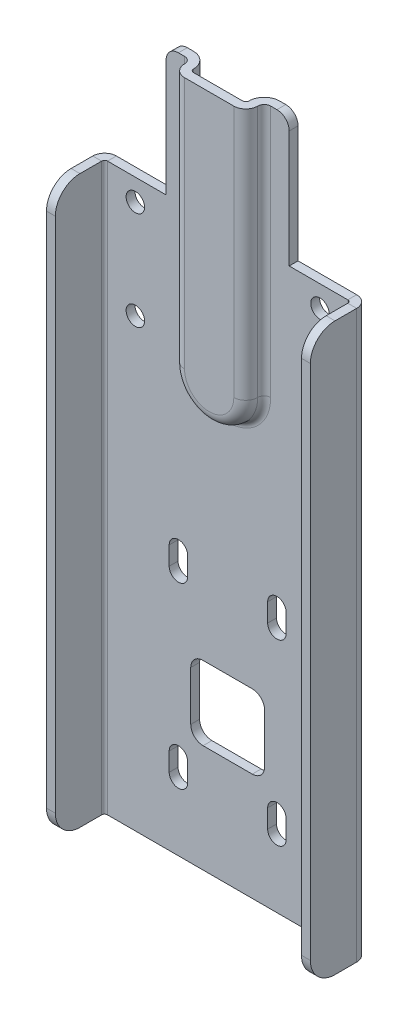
ISO-10303-21;
HEADER;
FILE_DESCRIPTION(('STEP AP214'),'2;1');
FILE_NAME('part.step','',(''),(''),'','','');
FILE_SCHEMA(('AUTOMOTIVE_DESIGN { 1 0 10303 214 1 1 1 1 }'));
ENDSEC;
DATA;
#1=APPLICATION_CONTEXT('core data for automotive mechanical design processes');
#2=APPLICATION_PROTOCOL_DEFINITION('international standard','automotive_design',2000,#1);
#3=PRODUCT_CONTEXT('',#1,'mechanical');
#4=PRODUCT('Part','Part','',(#3));
#5=PRODUCT_RELATED_PRODUCT_CATEGORY('part','',(#4));
#6=PRODUCT_DEFINITION_FORMATION('','',#4);
#7=PRODUCT_DEFINITION_CONTEXT('part definition',#1,'design');
#8=PRODUCT_DEFINITION('design','',#6,#7);
#9=PRODUCT_DEFINITION_SHAPE('','',#8);
#10=(LENGTH_UNIT() NAMED_UNIT(*) SI_UNIT(.MILLI.,.METRE.));
#11=(NAMED_UNIT(*) PLANE_ANGLE_UNIT() SI_UNIT($,.RADIAN.));
#12=(NAMED_UNIT(*) SI_UNIT($,.STERADIAN.) SOLID_ANGLE_UNIT());
#13=UNCERTAINTY_MEASURE_WITH_UNIT(LENGTH_MEASURE(1.E-05),#10,'distance_accuracy_value','');
#14=(GEOMETRIC_REPRESENTATION_CONTEXT(3) GLOBAL_UNCERTAINTY_ASSIGNED_CONTEXT((#13)) GLOBAL_UNIT_ASSIGNED_CONTEXT((#10,
#11,#12)) REPRESENTATION_CONTEXT('',''));
#15=CARTESIAN_POINT('',(0.,0.,0.));
#16=DIRECTION('',(0.,0.,1.));
#17=DIRECTION('',(1.,0.,0.));
#18=AXIS2_PLACEMENT_3D('',#15,#16,#17);
#19=CARTESIAN_POINT('',(-31.75,-146.05,0.));
#20=DIRECTION('',(0.,0.,1.));
#21=DIRECTION('',(1.,0.,0.));
#22=AXIS2_PLACEMENT_3D('',#19,#20,#21);
#23=PLANE('',#22);
#24=CARTESIAN_POINT('',(12.7,-82.54365,0.));
#25=DIRECTION('',(0.,0.,-1.));
#26=DIRECTION('',(-1.,0.,0.));
#27=AXIS2_PLACEMENT_3D('',#24,#25,#26);
#28=CIRCLE('',#27,2.38125);
#29=CARTESIAN_POINT('',(15.08125,-82.54365,0.));
#30=VERTEX_POINT('',#29);
#31=CARTESIAN_POINT('',(10.31875,-82.54365,0.));
#32=VERTEX_POINT('',#31);
#33=EDGE_CURVE('E561',#30,#32,#28,.T.);
#34=ORIENTED_EDGE('',*,*,#33,.T.);
#35=DIRECTION('',(0.,1.,0.));
#36=VECTOR('',#35,1.);
#37=CARTESIAN_POINT('',(10.31875,-82.54365,0.));
#38=LINE('',#37,#36);
#39=CARTESIAN_POINT('',(10.31875,-77.78115,0.));
#40=VERTEX_POINT('',#39);
#41=EDGE_CURVE('E564',#32,#40,#38,.T.);
#42=ORIENTED_EDGE('',*,*,#41,.T.);
#43=CARTESIAN_POINT('',(12.7,-77.78115,0.));
#44=DIRECTION('',(0.,0.,-1.));
#45=DIRECTION('',(-1.,0.,0.));
#46=AXIS2_PLACEMENT_3D('',#43,#44,#45);
#47=CIRCLE('',#46,2.38125);
#48=CARTESIAN_POINT('',(15.08125,-77.78115,0.));
#49=VERTEX_POINT('',#48);
#50=EDGE_CURVE('E568',#40,#49,#47,.T.);
#51=ORIENTED_EDGE('',*,*,#50,.T.);
#52=DIRECTION('',(0.,-1.,0.));
#53=VECTOR('',#52,1.);
#54=CARTESIAN_POINT('',(15.08125,-82.54365,0.));
#55=LINE('',#54,#53);
#56=EDGE_CURVE('E571',#49,#30,#55,.T.);
#57=ORIENTED_EDGE('',*,*,#56,.T.);
#58=EDGE_LOOP('',(#34,#42,#51,#57));
#59=FACE_BOUND('',#58,.T.);
#60=CARTESIAN_POINT('',(-12.7,-82.54365,0.));
#61=DIRECTION('',(0.,0.,-1.));
#62=DIRECTION('',(-1.,0.,0.));
#63=AXIS2_PLACEMENT_3D('',#60,#61,#62);
#64=CIRCLE('',#63,2.38125);
#65=CARTESIAN_POINT('',(-10.31875,-82.54365,0.));
#66=VERTEX_POINT('',#65);
#67=CARTESIAN_POINT('',(-15.08125,-82.54365,0.));
#68=VERTEX_POINT('',#67);
#69=EDGE_CURVE('E593',#66,#68,#64,.T.);
#70=ORIENTED_EDGE('',*,*,#69,.T.);
#71=DIRECTION('',(0.,1.,0.));
#72=VECTOR('',#71,1.);
#73=CARTESIAN_POINT('',(-15.08125,-82.54365,0.));
#74=LINE('',#73,#72);
#75=CARTESIAN_POINT('',(-15.08125,-77.78115,0.));
#76=VERTEX_POINT('',#75);
#77=EDGE_CURVE('E596',#68,#76,#74,.T.);
#78=ORIENTED_EDGE('',*,*,#77,.T.);
#79=CARTESIAN_POINT('',(-12.7,-77.78115,0.));
#80=DIRECTION('',(0.,0.,-1.));
#81=DIRECTION('',(-1.,0.,0.));
#82=AXIS2_PLACEMENT_3D('',#79,#80,#81);
#83=CIRCLE('',#82,2.38125);
#84=CARTESIAN_POINT('',(-10.31875,-77.78115,0.));
#85=VERTEX_POINT('',#84);
#86=EDGE_CURVE('E600',#76,#85,#83,.T.);
#87=ORIENTED_EDGE('',*,*,#86,.T.);
#88=DIRECTION('',(0.,-1.,0.));
#89=VECTOR('',#88,1.);
#90=CARTESIAN_POINT('',(-10.31875,-82.54365,0.));
#91=LINE('',#90,#89);
#92=EDGE_CURVE('E603',#85,#66,#91,.T.);
#93=ORIENTED_EDGE('',*,*,#92,.T.);
#94=EDGE_LOOP('',(#70,#78,#87,#93));
#95=FACE_BOUND('',#94,.T.);
#96=CARTESIAN_POINT('',(-12.7,-128.58115,0.));
#97=DIRECTION('',(0.,0.,-1.));
#98=DIRECTION('',(-1.,0.,0.));
#99=AXIS2_PLACEMENT_3D('',#96,#97,#98);
#100=CIRCLE('',#99,2.38125);
#101=CARTESIAN_POINT('',(-10.31875,-128.58115,0.));
#102=VERTEX_POINT('',#101);
#103=CARTESIAN_POINT('',(-15.08125,-128.58115,0.));
#104=VERTEX_POINT('',#103);
#105=EDGE_CURVE('E625',#102,#104,#100,.T.);
#106=ORIENTED_EDGE('',*,*,#105,.T.);
#107=DIRECTION('',(0.,1.,0.));
#108=VECTOR('',#107,1.);
#109=CARTESIAN_POINT('',(-15.08125,-128.58115,0.));
#110=LINE('',#109,#108);
#111=CARTESIAN_POINT('',(-15.08125,-123.81865,0.));
#112=VERTEX_POINT('',#111);
#113=EDGE_CURVE('E628',#104,#112,#110,.T.);
#114=ORIENTED_EDGE('',*,*,#113,.T.);
#115=CARTESIAN_POINT('',(-12.7,-123.81865,0.));
#116=DIRECTION('',(0.,0.,-1.));
#117=DIRECTION('',(-1.,0.,0.));
#118=AXIS2_PLACEMENT_3D('',#115,#116,#117);
#119=CIRCLE('',#118,2.38125);
#120=CARTESIAN_POINT('',(-10.31875,-123.81865,0.));
#121=VERTEX_POINT('',#120);
#122=EDGE_CURVE('E632',#112,#121,#119,.T.);
#123=ORIENTED_EDGE('',*,*,#122,.T.);
#124=DIRECTION('',(0.,-1.,0.));
#125=VECTOR('',#124,1.);
#126=CARTESIAN_POINT('',(-10.31875,-128.58115,0.));
#127=LINE('',#126,#125);
#128=EDGE_CURVE('E635',#121,#102,#127,.T.);
#129=ORIENTED_EDGE('',*,*,#128,.T.);
#130=EDGE_LOOP('',(#106,#114,#123,#129));
#131=FACE_BOUND('',#130,.T.);
#132=CARTESIAN_POINT('',(12.7,-123.81865,0.));
#133=DIRECTION('',(0.,0.,-1.));
#134=DIRECTION('',(-1.,0.,0.));
#135=AXIS2_PLACEMENT_3D('',#132,#133,#134);
#136=CIRCLE('',#135,2.38125);
#137=CARTESIAN_POINT('',(10.31875,-123.81865,0.));
#138=VERTEX_POINT('',#137);
#139=CARTESIAN_POINT('',(15.08125,-123.81865,0.));
#140=VERTEX_POINT('',#139);
#141=EDGE_CURVE('E657',#138,#140,#136,.T.);
#142=ORIENTED_EDGE('',*,*,#141,.T.);
#143=DIRECTION('',(0.,-1.,0.));
#144=VECTOR('',#143,1.);
#145=CARTESIAN_POINT('',(15.08125,-123.81865,0.));
#146=LINE('',#145,#144);
#147=CARTESIAN_POINT('',(15.08125,-128.58115,0.));
#148=VERTEX_POINT('',#147);
#149=EDGE_CURVE('E660',#140,#148,#146,.T.);
#150=ORIENTED_EDGE('',*,*,#149,.T.);
#151=CARTESIAN_POINT('',(12.7,-128.58115,0.));
#152=DIRECTION('',(0.,0.,-1.));
#153=DIRECTION('',(-1.,0.,0.));
#154=AXIS2_PLACEMENT_3D('',#151,#152,#153);
#155=CIRCLE('',#154,2.38125);
#156=CARTESIAN_POINT('',(10.31875,-128.58115,0.));
#157=VERTEX_POINT('',#156);
#158=EDGE_CURVE('E664',#148,#157,#155,.T.);
#159=ORIENTED_EDGE('',*,*,#158,.T.);
#160=DIRECTION('',(0.,1.,0.));
#161=VECTOR('',#160,1.);
#162=CARTESIAN_POINT('',(10.31875,-123.81865,0.));
#163=LINE('',#162,#161);
#164=EDGE_CURVE('E667',#157,#138,#163,.T.);
#165=ORIENTED_EDGE('',*,*,#164,.T.);
#166=EDGE_LOOP('',(#142,#150,#159,#165));
#167=FACE_BOUND('',#166,.T.);
#168=DIRECTION('',(-1.,0.,0.));
#169=VECTOR('',#168,1.);
#170=CARTESIAN_POINT('',(9.52499999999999,-118.26875,0.));
#171=LINE('',#170,#169);
#172=CARTESIAN_POINT('',(6.34999999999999,-118.26875,0.));
#173=VERTEX_POINT('',#172);
#174=CARTESIAN_POINT('',(-6.35,-118.26875,0.));
#175=VERTEX_POINT('',#174);
#176=EDGE_CURVE('E699',#173,#175,#171,.T.);
#177=ORIENTED_EDGE('',*,*,#176,.T.);
#178=CARTESIAN_POINT('',(-6.35000000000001,-115.09375,0.));
#179=DIRECTION('',(0.,0.,1.));
#180=DIRECTION('',(1.,0.,0.));
#181=AXIS2_PLACEMENT_3D('',#178,#179,#180);
#182=CIRCLE('',#181,3.175);
#183=CARTESIAN_POINT('',(-9.52500000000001,-115.09375,0.));
#184=VERTEX_POINT('',#183);
#185=EDGE_CURVE('E954',#175,#184,#182,.F.);
#186=ORIENTED_EDGE('',*,*,#185,.T.);
#187=DIRECTION('',(0.,1.,0.));
#188=VECTOR('',#187,1.);
#189=CARTESIAN_POINT('',(-9.52500000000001,-118.26875,0.));
#190=LINE('',#189,#188);
#191=CARTESIAN_POINT('',(-9.52500000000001,-102.39375,0.));
#192=VERTEX_POINT('',#191);
#193=EDGE_CURVE('E689',#184,#192,#190,.T.);
#194=ORIENTED_EDGE('',*,*,#193,.T.);
#195=CARTESIAN_POINT('',(-6.35000000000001,-102.39375,0.));
#196=DIRECTION('',(0.,0.,1.));
#197=DIRECTION('',(1.,0.,0.));
#198=AXIS2_PLACEMENT_3D('',#195,#196,#197);
#199=CIRCLE('',#198,3.175);
#200=CARTESIAN_POINT('',(-6.35,-99.21875,0.));
#201=VERTEX_POINT('',#200);
#202=EDGE_CURVE('E950',#192,#201,#199,.F.);
#203=ORIENTED_EDGE('',*,*,#202,.T.);
#204=DIRECTION('',(1.,0.,0.));
#205=VECTOR('',#204,1.);
#206=CARTESIAN_POINT('',(9.52499999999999,-99.21875,0.));
#207=LINE('',#206,#205);
#208=CARTESIAN_POINT('',(6.34999999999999,-99.21875,0.));
#209=VERTEX_POINT('',#208);
#210=EDGE_CURVE('E692',#201,#209,#207,.T.);
#211=ORIENTED_EDGE('',*,*,#210,.T.);
#212=CARTESIAN_POINT('',(6.34999999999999,-102.39375,0.));
#213=DIRECTION('',(0.,0.,1.));
#214=DIRECTION('',(1.,0.,0.));
#215=AXIS2_PLACEMENT_3D('',#212,#213,#214);
#216=CIRCLE('',#215,3.175);
#217=CARTESIAN_POINT('',(9.52499999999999,-102.39375,0.));
#218=VERTEX_POINT('',#217);
#219=EDGE_CURVE('E958',#209,#218,#216,.F.);
#220=ORIENTED_EDGE('',*,*,#219,.T.);
#221=DIRECTION('',(0.,-1.,0.));
#222=VECTOR('',#221,1.);
#223=CARTESIAN_POINT('',(9.52499999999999,-118.26875,0.));
#224=LINE('',#223,#222);
#225=CARTESIAN_POINT('',(9.52499999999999,-115.09375,0.));
#226=VERTEX_POINT('',#225);
#227=EDGE_CURVE('E696',#218,#226,#224,.T.);
#228=ORIENTED_EDGE('',*,*,#227,.T.);
#229=CARTESIAN_POINT('',(6.34999999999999,-115.09375,0.));
#230=DIRECTION('',(0.,0.,1.));
#231=DIRECTION('',(1.,0.,0.));
#232=AXIS2_PLACEMENT_3D('',#229,#230,#231);
#233=CIRCLE('',#232,3.175);
#234=EDGE_CURVE('E45',#226,#173,#233,.F.);
#235=ORIENTED_EDGE('',*,*,#234,.T.);
#236=EDGE_LOOP('',(#177,#186,#194,#203,#211,#220,#228,#235));
#237=FACE_BOUND('',#236,.T.);
#238=CARTESIAN_POINT('',(-23.8125,-30.95625,0.));
#239=DIRECTION('',(0.,0.,1.));
#240=DIRECTION('',(1.,0.,0.));
#241=AXIS2_PLACEMENT_3D('',#238,#239,#240);
#242=CIRCLE('',#241,2.38125);
#243=CARTESIAN_POINT('',(-21.43125,-30.95625,0.));
#244=VERTEX_POINT('',#243);
#245=EDGE_CURVE('E702',#244,#244,#242,.T.);
#246=ORIENTED_EDGE('',*,*,#245,.F.);
#247=EDGE_LOOP('',(#246));
#248=FACE_BOUND('',#247,.T.);
#249=CARTESIAN_POINT('',(23.8125,-30.95625,0.));
#250=DIRECTION('',(0.,0.,1.));
#251=DIRECTION('',(1.,0.,0.));
#252=AXIS2_PLACEMENT_3D('',#249,#250,#251);
#253=CIRCLE('',#252,2.38125);
#254=CARTESIAN_POINT('',(26.19375,-30.95625,0.));
#255=VERTEX_POINT('',#254);
#256=EDGE_CURVE('E716',#255,#255,#253,.T.);
#257=ORIENTED_EDGE('',*,*,#256,.F.);
#258=EDGE_LOOP('',(#257));
#259=FACE_BOUND('',#258,.T.);
#260=CARTESIAN_POINT('',(-23.8125,-5.55625,0.));
#261=DIRECTION('',(0.,0.,1.));
#262=DIRECTION('',(1.,0.,0.));
#263=AXIS2_PLACEMENT_3D('',#260,#261,#262);
#264=CIRCLE('',#263,2.38125);
#265=CARTESIAN_POINT('',(-21.43125,-5.55625,0.));
#266=VERTEX_POINT('',#265);
#267=EDGE_CURVE('E722',#266,#266,#264,.T.);
#268=ORIENTED_EDGE('',*,*,#267,.F.);
#269=EDGE_LOOP('',(#268));
#270=FACE_BOUND('',#269,.T.);
#271=CARTESIAN_POINT('',(23.8125,-5.55625,0.));
#272=DIRECTION('',(0.,0.,1.));
#273=DIRECTION('',(1.,0.,0.));
#274=AXIS2_PLACEMENT_3D('',#271,#272,#273);
#275=CIRCLE('',#274,2.38125);
#276=CARTESIAN_POINT('',(26.19375,-5.55625,0.));
#277=VERTEX_POINT('',#276);
#278=EDGE_CURVE('E728',#277,#277,#275,.T.);
#279=ORIENTED_EDGE('',*,*,#278,.F.);
#280=EDGE_LOOP('',(#279));
#281=FACE_BOUND('',#280,.T.);
#282=CARTESIAN_POINT('',(0.,-31.75,0.));
#283=DIRECTION('',(0.,0.,-1.));
#284=DIRECTION('',(-1.,0.,0.));
#285=AXIS2_PLACEMENT_3D('',#282,#283,#284);
#286=CIRCLE('',#285,11.10615);
#287=CARTESIAN_POINT('',(11.10615,-31.75,0.));
#288=VERTEX_POINT('',#287);
#289=CARTESIAN_POINT('',(-11.10615,-31.75,0.));
#290=VERTEX_POINT('',#289);
#291=EDGE_CURVE('E52',#288,#290,#286,.T.);
#292=ORIENTED_EDGE('',*,*,#291,.T.);
#293=DIRECTION('',(0.,1.,0.));
#294=VECTOR('',#293,1.);
#295=CARTESIAN_POINT('',(-11.10615,-31.75,0.));
#296=LINE('',#295,#294);
#297=CARTESIAN_POINT('',(-11.10615,33.3375,0.));
#298=VERTEX_POINT('',#297);
#299=EDGE_CURVE('E451',#290,#298,#296,.T.);
#300=ORIENTED_EDGE('',*,*,#299,.T.);
#301=DIRECTION('',(-1.,0.,0.));
#302=VECTOR('',#301,1.);
#303=CARTESIAN_POINT('',(-15.875,33.3375,0.));
#304=LINE('',#303,#302);
#305=CARTESIAN_POINT('',(-12.7,33.3375,0.));
#306=VERTEX_POINT('',#305);
#307=EDGE_CURVE('E750',#298,#306,#304,.T.);
#308=ORIENTED_EDGE('',*,*,#307,.T.);
#309=CARTESIAN_POINT('',(-12.7,30.1625,0.));
#310=DIRECTION('',(0.,0.,1.));
#311=DIRECTION('',(1.,0.,0.));
#312=AXIS2_PLACEMENT_3D('',#309,#310,#311);
#313=CIRCLE('',#312,3.175);
#314=CARTESIAN_POINT('',(-15.875,30.1625,0.));
#315=VERTEX_POINT('',#314);
#316=EDGE_CURVE('E912',#306,#315,#313,.T.);
#317=ORIENTED_EDGE('',*,*,#316,.T.);
#318=DIRECTION('',(0.,-1.,0.));
#319=VECTOR('',#318,1.);
#320=CARTESIAN_POINT('',(-15.875,33.3375,0.));
#321=LINE('',#320,#319);
#322=CARTESIAN_POINT('',(-15.875,0.,0.));
#323=VERTEX_POINT('',#322);
#324=EDGE_CURVE('E741',#315,#323,#321,.T.);
#325=ORIENTED_EDGE('',*,*,#324,.T.);
#326=DIRECTION('',(1.,0.,0.));
#327=VECTOR('',#326,1.);
#328=CARTESIAN_POINT('',(-31.75,0.,0.));
#329=LINE('',#328,#327);
#330=CARTESIAN_POINT('',(-30.988,0.,0.));
#331=VERTEX_POINT('',#330);
#332=EDGE_CURVE('E814',#331,#323,#329,.T.);
#333=ORIENTED_EDGE('',*,*,#332,.F.);
#334=DIRECTION('',(0.,1.,0.));
#335=VECTOR('',#334,1.);
#336=CARTESIAN_POINT('',(-30.988,-146.05,0.));
#337=LINE('',#336,#335);
#338=CARTESIAN_POINT('',(-30.988,-146.05,0.));
#339=VERTEX_POINT('',#338);
#340=EDGE_CURVE('E826',#339,#331,#337,.T.);
#341=ORIENTED_EDGE('',*,*,#340,.F.);
#342=DIRECTION('',(1.,0.,0.));
#343=VECTOR('',#342,1.);
#344=CARTESIAN_POINT('',(-31.75,-146.05,0.));
#345=LINE('',#344,#343);
#346=CARTESIAN_POINT('',(30.988,-146.05,0.));
#347=VERTEX_POINT('',#346);
#348=EDGE_CURVE('E784',#339,#347,#345,.T.);
#349=ORIENTED_EDGE('',*,*,#348,.T.);
#350=DIRECTION('',(0.,1.,0.));
#351=VECTOR('',#350,1.);
#352=CARTESIAN_POINT('',(30.988,-146.05,0.));
#353=LINE('',#352,#351);
#354=CARTESIAN_POINT('',(30.988,0.,0.));
#355=VERTEX_POINT('',#354);
#356=EDGE_CURVE('E823',#347,#355,#353,.T.);
#357=ORIENTED_EDGE('',*,*,#356,.T.);
#358=CARTESIAN_POINT('',(15.875,0.,0.));
#359=VERTEX_POINT('',#358);
#360=EDGE_CURVE('E813',#359,#355,#329,.T.);
#361=ORIENTED_EDGE('',*,*,#360,.F.);
#362=DIRECTION('',(0.,1.,0.));
#363=VECTOR('',#362,1.);
#364=CARTESIAN_POINT('',(15.875,33.3375,0.));
#365=LINE('',#364,#363);
#366=CARTESIAN_POINT('',(15.875,30.1625,0.));
#367=VERTEX_POINT('',#366);
#368=EDGE_CURVE('E734',#359,#367,#365,.T.);
#369=ORIENTED_EDGE('',*,*,#368,.T.);
#370=CARTESIAN_POINT('',(12.7,30.1625,0.));
#371=DIRECTION('',(0.,0.,1.));
#372=DIRECTION('',(1.,0.,0.));
#373=AXIS2_PLACEMENT_3D('',#370,#371,#372);
#374=CIRCLE('',#373,3.175);
#375=CARTESIAN_POINT('',(12.7,33.3375,0.));
#376=VERTEX_POINT('',#375);
#377=EDGE_CURVE('E914',#367,#376,#374,.T.);
#378=ORIENTED_EDGE('',*,*,#377,.T.);
#379=CARTESIAN_POINT('',(11.10615,33.3375,0.));
#380=VERTEX_POINT('',#379);
#381=EDGE_CURVE('E751',#376,#380,#304,.T.);
#382=ORIENTED_EDGE('',*,*,#381,.T.);
#383=DIRECTION('',(0.,-1.,0.));
#384=VECTOR('',#383,1.);
#385=CARTESIAN_POINT('',(11.10615,-31.75,0.));
#386=LINE('',#385,#384);
#387=EDGE_CURVE('E492',#380,#288,#386,.T.);
#388=ORIENTED_EDGE('',*,*,#387,.T.);
#389=EDGE_LOOP('',(#292,#300,#308,#317,#325,#333,#341,#349,#357,#361,#369,#378,#382,#388));
#390=FACE_BOUND('',#389,.T.);
#391=ADVANCED_FACE('F37',(#59,#95,#131,#167,#237,#248,#259,#270,#281,#390),#23,.T.);
#392=CARTESIAN_POINT('',(-31.75,-146.05,-2.286));
#393=DIRECTION('',(0.,0.,1.));
#394=DIRECTION('',(1.,0.,0.));
#395=AXIS2_PLACEMENT_3D('',#392,#393,#394);
#396=PLANE('',#395);
#397=CARTESIAN_POINT('',(23.8125,-5.55625,-2.286));
#398=DIRECTION('',(0.,0.,1.));
#399=DIRECTION('',(1.,0.,0.));
#400=AXIS2_PLACEMENT_3D('',#397,#398,#399);
#401=CIRCLE('',#400,2.38125);
#402=CARTESIAN_POINT('',(26.19375,-5.55625,-2.286));
#403=VERTEX_POINT('',#402);
#404=EDGE_CURVE('E731',#403,#403,#401,.T.);
#405=ORIENTED_EDGE('',*,*,#404,.T.);
#406=EDGE_LOOP('',(#405));
#407=FACE_BOUND('',#406,.T.);
#408=CARTESIAN_POINT('',(-23.8125,-5.55625,-2.286));
#409=DIRECTION('',(0.,0.,1.));
#410=DIRECTION('',(1.,0.,0.));
#411=AXIS2_PLACEMENT_3D('',#408,#409,#410);
#412=CIRCLE('',#411,2.38125);
#413=CARTESIAN_POINT('',(-21.43125,-5.55625,-2.286));
#414=VERTEX_POINT('',#413);
#415=EDGE_CURVE('E725',#414,#414,#412,.T.);
#416=ORIENTED_EDGE('',*,*,#415,.T.);
#417=EDGE_LOOP('',(#416));
#418=FACE_BOUND('',#417,.T.);
#419=CARTESIAN_POINT('',(23.8125,-30.95625,-2.286));
#420=DIRECTION('',(0.,0.,1.));
#421=DIRECTION('',(1.,0.,0.));
#422=AXIS2_PLACEMENT_3D('',#419,#420,#421);
#423=CIRCLE('',#422,2.38125);
#424=CARTESIAN_POINT('',(26.19375,-30.95625,-2.286));
#425=VERTEX_POINT('',#424);
#426=EDGE_CURVE('E719',#425,#425,#423,.T.);
#427=ORIENTED_EDGE('',*,*,#426,.T.);
#428=EDGE_LOOP('',(#427));
#429=FACE_BOUND('',#428,.T.);
#430=CARTESIAN_POINT('',(-23.8125,-30.95625,-2.286));
#431=DIRECTION('',(0.,0.,1.));
#432=DIRECTION('',(1.,0.,0.));
#433=AXIS2_PLACEMENT_3D('',#430,#431,#432);
#434=CIRCLE('',#433,2.38125);
#435=CARTESIAN_POINT('',(-21.43125,-30.95625,-2.286));
#436=VERTEX_POINT('',#435);
#437=EDGE_CURVE('E713',#436,#436,#434,.T.);
#438=ORIENTED_EDGE('',*,*,#437,.T.);
#439=EDGE_LOOP('',(#438));
#440=FACE_BOUND('',#439,.T.);
#441=DIRECTION('',(1.,0.,0.));
#442=VECTOR('',#441,1.);
#443=CARTESIAN_POINT('',(9.52499999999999,-99.21875,-2.286));
#444=LINE('',#443,#442);
#445=CARTESIAN_POINT('',(-6.35,-99.21875,-2.286));
#446=VERTEX_POINT('',#445);
#447=CARTESIAN_POINT('',(6.34999999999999,-99.21875,-2.286));
#448=VERTEX_POINT('',#447);
#449=EDGE_CURVE('E705',#446,#448,#444,.T.);
#450=ORIENTED_EDGE('',*,*,#449,.F.);
#451=CARTESIAN_POINT('',(-6.35000000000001,-102.39375,-2.286));
#452=DIRECTION('',(0.,0.,1.));
#453=DIRECTION('',(1.,0.,0.));
#454=AXIS2_PLACEMENT_3D('',#451,#452,#453);
#455=CIRCLE('',#454,3.175);
#456=CARTESIAN_POINT('',(-9.52500000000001,-102.39375,-2.286));
#457=VERTEX_POINT('',#456);
#458=EDGE_CURVE('E948',#446,#457,#455,.T.);
#459=ORIENTED_EDGE('',*,*,#458,.T.);
#460=DIRECTION('',(0.,1.,0.));
#461=VECTOR('',#460,1.);
#462=CARTESIAN_POINT('',(-9.52500000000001,-118.26875,-2.286));
#463=LINE('',#462,#461);
#464=CARTESIAN_POINT('',(-9.52500000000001,-115.09375,-2.286));
#465=VERTEX_POINT('',#464);
#466=EDGE_CURVE('E682',#465,#457,#463,.T.);
#467=ORIENTED_EDGE('',*,*,#466,.F.);
#468=CARTESIAN_POINT('',(-6.35000000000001,-115.09375,-2.286));
#469=DIRECTION('',(0.,0.,1.));
#470=DIRECTION('',(1.,0.,0.));
#471=AXIS2_PLACEMENT_3D('',#468,#469,#470);
#472=CIRCLE('',#471,3.175);
#473=CARTESIAN_POINT('',(-6.35,-118.26875,-2.286));
#474=VERTEX_POINT('',#473);
#475=EDGE_CURVE('E952',#465,#474,#472,.T.);
#476=ORIENTED_EDGE('',*,*,#475,.T.);
#477=DIRECTION('',(-1.,0.,0.));
#478=VECTOR('',#477,1.);
#479=CARTESIAN_POINT('',(9.52499999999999,-118.26875,-2.286));
#480=LINE('',#479,#478);
#481=CARTESIAN_POINT('',(6.34999999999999,-118.26875,-2.286));
#482=VERTEX_POINT('',#481);
#483=EDGE_CURVE('E693',#482,#474,#480,.T.);
#484=ORIENTED_EDGE('',*,*,#483,.F.);
#485=CARTESIAN_POINT('',(6.34999999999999,-115.09375,-2.286));
#486=DIRECTION('',(0.,0.,1.));
#487=DIRECTION('',(1.,0.,0.));
#488=AXIS2_PLACEMENT_3D('',#485,#486,#487);
#489=CIRCLE('',#488,3.175);
#490=CARTESIAN_POINT('',(9.52499999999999,-115.09375,-2.286));
#491=VERTEX_POINT('',#490);
#492=EDGE_CURVE('E960',#482,#491,#489,.T.);
#493=ORIENTED_EDGE('',*,*,#492,.T.);
#494=DIRECTION('',(0.,-1.,0.));
#495=VECTOR('',#494,1.);
#496=CARTESIAN_POINT('',(9.52499999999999,-118.26875,-2.286));
#497=LINE('',#496,#495);
#498=CARTESIAN_POINT('',(9.52499999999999,-102.39375,-2.286));
#499=VERTEX_POINT('',#498);
#500=EDGE_CURVE('E708',#499,#491,#497,.T.);
#501=ORIENTED_EDGE('',*,*,#500,.F.);
#502=CARTESIAN_POINT('',(6.34999999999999,-102.39375,-2.286));
#503=DIRECTION('',(0.,0.,1.));
#504=DIRECTION('',(1.,0.,0.));
#505=AXIS2_PLACEMENT_3D('',#502,#503,#504);
#506=CIRCLE('',#505,3.175);
#507=EDGE_CURVE('E956',#499,#448,#506,.T.);
#508=ORIENTED_EDGE('',*,*,#507,.T.);
#509=EDGE_LOOP('',(#450,#459,#467,#476,#484,#493,#501,#508));
#510=FACE_BOUND('',#509,.T.);
#511=DIRECTION('',(0.,-1.,0.));
#512=VECTOR('',#511,1.);
#513=CARTESIAN_POINT('',(15.08125,-123.81865,-2.286));
#514=LINE('',#513,#512);
#515=CARTESIAN_POINT('',(15.08125,-123.81865,-2.286));
#516=VERTEX_POINT('',#515);
#517=CARTESIAN_POINT('',(15.08125,-128.58115,-2.286));
#518=VERTEX_POINT('',#517);
#519=EDGE_CURVE('E672',#516,#518,#514,.T.);
#520=ORIENTED_EDGE('',*,*,#519,.F.);
#521=CARTESIAN_POINT('',(12.7,-123.81865,-2.286));
#522=DIRECTION('',(0.,0.,-1.));
#523=DIRECTION('',(-1.,0.,0.));
#524=AXIS2_PLACEMENT_3D('',#521,#522,#523);
#525=CIRCLE('',#524,2.38125);
#526=CARTESIAN_POINT('',(10.31875,-123.81865,-2.286));
#527=VERTEX_POINT('',#526);
#528=EDGE_CURVE('E650',#527,#516,#525,.T.);
#529=ORIENTED_EDGE('',*,*,#528,.F.);
#530=DIRECTION('',(0.,1.,0.));
#531=VECTOR('',#530,1.);
#532=CARTESIAN_POINT('',(10.31875,-123.81865,-2.286));
#533=LINE('',#532,#531);
#534=CARTESIAN_POINT('',(10.31875,-128.58115,-2.286));
#535=VERTEX_POINT('',#534);
#536=EDGE_CURVE('E661',#535,#527,#533,.T.);
#537=ORIENTED_EDGE('',*,*,#536,.F.);
#538=CARTESIAN_POINT('',(12.7,-128.58115,-2.286));
#539=DIRECTION('',(0.,0.,-1.));
#540=DIRECTION('',(-1.,0.,0.));
#541=AXIS2_PLACEMENT_3D('',#538,#539,#540);
#542=CIRCLE('',#541,2.38125);
#543=EDGE_CURVE('E675',#518,#535,#542,.T.);
#544=ORIENTED_EDGE('',*,*,#543,.F.);
#545=EDGE_LOOP('',(#520,#529,#537,#544));
#546=FACE_BOUND('',#545,.T.);
#547=DIRECTION('',(0.,1.,0.));
#548=VECTOR('',#547,1.);
#549=CARTESIAN_POINT('',(-15.08125,-128.58115,-2.286));
#550=LINE('',#549,#548);
#551=CARTESIAN_POINT('',(-15.08125,-128.58115,-2.286));
#552=VERTEX_POINT('',#551);
#553=CARTESIAN_POINT('',(-15.08125,-123.81865,-2.286));
#554=VERTEX_POINT('',#553);
#555=EDGE_CURVE('E640',#552,#554,#550,.T.);
#556=ORIENTED_EDGE('',*,*,#555,.F.);
#557=CARTESIAN_POINT('',(-12.7,-128.58115,-2.286));
#558=DIRECTION('',(0.,0.,-1.));
#559=DIRECTION('',(-1.,0.,0.));
#560=AXIS2_PLACEMENT_3D('',#557,#558,#559);
#561=CIRCLE('',#560,2.38125);
#562=CARTESIAN_POINT('',(-10.31875,-128.58115,-2.286));
#563=VERTEX_POINT('',#562);
#564=EDGE_CURVE('E618',#563,#552,#561,.T.);
#565=ORIENTED_EDGE('',*,*,#564,.F.);
#566=DIRECTION('',(0.,-1.,0.));
#567=VECTOR('',#566,1.);
#568=CARTESIAN_POINT('',(-10.31875,-128.58115,-2.286));
#569=LINE('',#568,#567);
#570=CARTESIAN_POINT('',(-10.31875,-123.81865,-2.286));
#571=VERTEX_POINT('',#570);
#572=EDGE_CURVE('E629',#571,#563,#569,.T.);
#573=ORIENTED_EDGE('',*,*,#572,.F.);
#574=CARTESIAN_POINT('',(-12.7,-123.81865,-2.286));
#575=DIRECTION('',(0.,0.,-1.));
#576=DIRECTION('',(-1.,0.,0.));
#577=AXIS2_PLACEMENT_3D('',#574,#575,#576);
#578=CIRCLE('',#577,2.38125);
#579=EDGE_CURVE('E643',#554,#571,#578,.T.);
#580=ORIENTED_EDGE('',*,*,#579,.F.);
#581=EDGE_LOOP('',(#556,#565,#573,#580));
#582=FACE_BOUND('',#581,.T.);
#583=DIRECTION('',(0.,1.,0.));
#584=VECTOR('',#583,1.);
#585=CARTESIAN_POINT('',(-15.08125,-82.54365,-2.286));
#586=LINE('',#585,#584);
#587=CARTESIAN_POINT('',(-15.08125,-82.54365,-2.286));
#588=VERTEX_POINT('',#587);
#589=CARTESIAN_POINT('',(-15.08125,-77.78115,-2.286));
#590=VERTEX_POINT('',#589);
#591=EDGE_CURVE('E608',#588,#590,#586,.T.);
#592=ORIENTED_EDGE('',*,*,#591,.F.);
#593=CARTESIAN_POINT('',(-12.7,-82.54365,-2.286));
#594=DIRECTION('',(0.,0.,-1.));
#595=DIRECTION('',(-1.,0.,0.));
#596=AXIS2_PLACEMENT_3D('',#593,#594,#595);
#597=CIRCLE('',#596,2.38125);
#598=CARTESIAN_POINT('',(-10.31875,-82.54365,-2.286));
#599=VERTEX_POINT('',#598);
#600=EDGE_CURVE('E586',#599,#588,#597,.T.);
#601=ORIENTED_EDGE('',*,*,#600,.F.);
#602=DIRECTION('',(0.,-1.,0.));
#603=VECTOR('',#602,1.);
#604=CARTESIAN_POINT('',(-10.31875,-82.54365,-2.286));
#605=LINE('',#604,#603);
#606=CARTESIAN_POINT('',(-10.31875,-77.78115,-2.286));
#607=VERTEX_POINT('',#606);
#608=EDGE_CURVE('E597',#607,#599,#605,.T.);
#609=ORIENTED_EDGE('',*,*,#608,.F.);
#610=CARTESIAN_POINT('',(-12.7,-77.78115,-2.286));
#611=DIRECTION('',(0.,0.,-1.));
#612=DIRECTION('',(-1.,0.,0.));
#613=AXIS2_PLACEMENT_3D('',#610,#611,#612);
#614=CIRCLE('',#613,2.38125);
#615=EDGE_CURVE('E611',#590,#607,#614,.T.);
#616=ORIENTED_EDGE('',*,*,#615,.F.);
#617=EDGE_LOOP('',(#592,#601,#609,#616));
#618=FACE_BOUND('',#617,.T.);
#619=DIRECTION('',(0.,1.,0.));
#620=VECTOR('',#619,1.);
#621=CARTESIAN_POINT('',(10.31875,-82.54365,-2.286));
#622=LINE('',#621,#620);
#623=CARTESIAN_POINT('',(10.31875,-82.54365,-2.286));
#624=VERTEX_POINT('',#623);
#625=CARTESIAN_POINT('',(10.31875,-77.78115,-2.286));
#626=VERTEX_POINT('',#625);
#627=EDGE_CURVE('E576',#624,#626,#622,.T.);
#628=ORIENTED_EDGE('',*,*,#627,.F.);
#629=CARTESIAN_POINT('',(12.7,-82.54365,-2.286));
#630=DIRECTION('',(0.,0.,-1.));
#631=DIRECTION('',(-1.,0.,0.));
#632=AXIS2_PLACEMENT_3D('',#629,#630,#631);
#633=CIRCLE('',#632,2.38125);
#634=CARTESIAN_POINT('',(15.08125,-82.54365,-2.286));
#635=VERTEX_POINT('',#634);
#636=EDGE_CURVE('E558',#635,#624,#633,.T.);
#637=ORIENTED_EDGE('',*,*,#636,.F.);
#638=DIRECTION('',(0.,-1.,0.));
#639=VECTOR('',#638,1.);
#640=CARTESIAN_POINT('',(15.08125,-82.54365,-2.286));
#641=LINE('',#640,#639);
#642=CARTESIAN_POINT('',(15.08125,-77.78115,-2.286));
#643=VERTEX_POINT('',#642);
#644=EDGE_CURVE('E565',#643,#635,#641,.T.);
#645=ORIENTED_EDGE('',*,*,#644,.F.);
#646=CARTESIAN_POINT('',(12.7,-77.78115,-2.286));
#647=DIRECTION('',(0.,0.,-1.));
#648=DIRECTION('',(-1.,0.,0.));
#649=AXIS2_PLACEMENT_3D('',#646,#647,#648);
#650=CIRCLE('',#649,2.38125);
#651=EDGE_CURVE('E579',#626,#643,#650,.T.);
#652=ORIENTED_EDGE('',*,*,#651,.F.);
#653=EDGE_LOOP('',(#628,#637,#645,#652));
#654=FACE_BOUND('',#653,.T.);
#655=DIRECTION('',(0.,1.,0.));
#656=VECTOR('',#655,1.);
#657=CARTESIAN_POINT('',(11.10615,-31.75,-2.286));
#658=LINE('',#657,#656);
#659=CARTESIAN_POINT('',(11.10615,33.3375,-2.286));
#660=VERTEX_POINT('',#659);
#661=CARTESIAN_POINT('',(11.10615,-31.75,-2.286));
#662=VERTEX_POINT('',#661);
#663=EDGE_CURVE('E554',#660,#662,#658,.F.);
#664=ORIENTED_EDGE('',*,*,#663,.F.);
#665=DIRECTION('',(-1.,0.,0.));
#666=VECTOR('',#665,1.);
#667=CARTESIAN_POINT('',(-15.875,33.3375,-2.286));
#668=LINE('',#667,#666);
#669=CARTESIAN_POINT('',(12.7,33.3375,-2.286));
#670=VERTEX_POINT('',#669);
#671=EDGE_CURVE('E742',#670,#660,#668,.T.);
#672=ORIENTED_EDGE('',*,*,#671,.F.);
#673=CARTESIAN_POINT('',(12.7,30.1625,-2.286));
#674=DIRECTION('',(0.,0.,1.));
#675=DIRECTION('',(1.,0.,0.));
#676=AXIS2_PLACEMENT_3D('',#673,#674,#675);
#677=CIRCLE('',#676,3.175);
#678=CARTESIAN_POINT('',(15.875,30.1625,-2.286));
#679=VERTEX_POINT('',#678);
#680=EDGE_CURVE('E924',#670,#679,#677,.F.);
#681=ORIENTED_EDGE('',*,*,#680,.T.);
#682=DIRECTION('',(0.,1.,0.));
#683=VECTOR('',#682,1.);
#684=CARTESIAN_POINT('',(15.875,33.3375,-2.286));
#685=LINE('',#684,#683);
#686=CARTESIAN_POINT('',(15.875,0.,-2.286));
#687=VERTEX_POINT('',#686);
#688=EDGE_CURVE('E737',#687,#679,#685,.T.);
#689=ORIENTED_EDGE('',*,*,#688,.F.);
#690=DIRECTION('',(1.,0.,0.));
#691=VECTOR('',#690,1.);
#692=CARTESIAN_POINT('',(-31.75,0.,-2.286));
#693=LINE('',#692,#691);
#694=CARTESIAN_POINT('',(30.988,0.,-2.286));
#695=VERTEX_POINT('',#694);
#696=EDGE_CURVE('E799',#687,#695,#693,.T.);
#697=ORIENTED_EDGE('',*,*,#696,.T.);
#698=DIRECTION('',(0.,1.,0.));
#699=VECTOR('',#698,1.);
#700=CARTESIAN_POINT('',(30.988,-146.05,-2.286));
#701=LINE('',#700,#699);
#702=CARTESIAN_POINT('',(30.988,-146.05,-2.286));
#703=VERTEX_POINT('',#702);
#704=EDGE_CURVE('E844',#703,#695,#701,.T.);
#705=ORIENTED_EDGE('',*,*,#704,.F.);
#706=DIRECTION('',(1.,0.,0.));
#707=VECTOR('',#706,1.);
#708=CARTESIAN_POINT('',(-31.75,-146.05,-2.286));
#709=LINE('',#708,#707);
#710=CARTESIAN_POINT('',(-30.988,-146.05,-2.286));
#711=VERTEX_POINT('',#710);
#712=EDGE_CURVE('E771',#711,#703,#709,.T.);
#713=ORIENTED_EDGE('',*,*,#712,.F.);
#714=DIRECTION('',(0.,1.,0.));
#715=VECTOR('',#714,1.);
#716=CARTESIAN_POINT('',(-30.988,-146.05,-2.286));
#717=LINE('',#716,#715);
#718=CARTESIAN_POINT('',(-30.988,0.,-2.286));
#719=VERTEX_POINT('',#718);
#720=EDGE_CURVE('E841',#711,#719,#717,.T.);
#721=ORIENTED_EDGE('',*,*,#720,.T.);
#722=CARTESIAN_POINT('',(-15.875,0.,-2.286));
#723=VERTEX_POINT('',#722);
#724=EDGE_CURVE('E800',#719,#723,#693,.T.);
#725=ORIENTED_EDGE('',*,*,#724,.T.);
#726=DIRECTION('',(0.,-1.,0.));
#727=VECTOR('',#726,1.);
#728=CARTESIAN_POINT('',(-15.875,33.3375,-2.286));
#729=LINE('',#728,#727);
#730=CARTESIAN_POINT('',(-15.875,30.1625,-2.286));
#731=VERTEX_POINT('',#730);
#732=EDGE_CURVE('E745',#731,#723,#729,.T.);
#733=ORIENTED_EDGE('',*,*,#732,.F.);
#734=CARTESIAN_POINT('',(-12.7,30.1625,-2.286));
#735=DIRECTION('',(0.,0.,1.));
#736=DIRECTION('',(1.,0.,0.));
#737=AXIS2_PLACEMENT_3D('',#734,#735,#736);
#738=CIRCLE('',#737,3.175);
#739=CARTESIAN_POINT('',(-12.7,33.3375,-2.286));
#740=VERTEX_POINT('',#739);
#741=EDGE_CURVE('E921',#731,#740,#738,.F.);
#742=ORIENTED_EDGE('',*,*,#741,.T.);
#743=CARTESIAN_POINT('',(-11.10615,33.3375,-2.286));
#744=VERTEX_POINT('',#743);
#745=EDGE_CURVE('E740',#744,#740,#668,.T.);
#746=ORIENTED_EDGE('',*,*,#745,.F.);
#747=DIRECTION('',(0.,-1.,0.));
#748=VECTOR('',#747,1.);
#749=CARTESIAN_POINT('',(-11.10615,33.3375,-2.286));
#750=LINE('',#749,#748);
#751=CARTESIAN_POINT('',(-11.10615,-31.75,-2.286));
#752=VERTEX_POINT('',#751);
#753=EDGE_CURVE('E60',#752,#744,#750,.F.);
#754=ORIENTED_EDGE('',*,*,#753,.F.);
#755=CARTESIAN_POINT('',(0.,-31.75,-2.286));
#756=DIRECTION('',(0.,0.,-1.));
#757=DIRECTION('',(0.,1.,0.));
#758=AXIS2_PLACEMENT_3D('',#755,#756,#757);
#759=CIRCLE('',#758,11.10615);
#760=EDGE_CURVE('E433',#662,#752,#759,.T.);
#761=ORIENTED_EDGE('',*,*,#760,.F.);
#762=EDGE_LOOP('',(#664,#672,#681,#689,#697,#705,#713,#721,#725,#733,#742,#746,#754,#761));
#763=FACE_BOUND('',#762,.T.);
#764=ADVANCED_FACE('F977',(#407,#418,#429,#440,#510,#546,#582,#618,#654,#763),#396,.F.);
#765=CARTESIAN_POINT('',(-15.875,33.3375,-2.286));
#766=DIRECTION('',(0.,1.,0.));
#767=DIRECTION('',(0.,0.,1.));
#768=AXIS2_PLACEMENT_3D('',#765,#766,#767);
#769=PLANE('',#768);
#770=CARTESIAN_POINT('',(-11.10615,33.3375,1.6764));
#771=DIRECTION('',(0.,-1.,0.));
#772=DIRECTION('',(1.,0.,0.));
#773=AXIS2_PLACEMENT_3D('',#770,#771,#772);
#774=CIRCLE('',#773,3.9624);
#775=CARTESIAN_POINT('',(-7.14375,33.3375,1.6764));
#776=VERTEX_POINT('',#775);
#777=EDGE_CURVE('E459',#744,#776,#774,.T.);
#778=ORIENTED_EDGE('',*,*,#777,.F.);
#779=ORIENTED_EDGE('',*,*,#745,.T.);
#780=DIRECTION('',(0.,0.,1.));
#781=VECTOR('',#780,1.);
#782=CARTESIAN_POINT('',(-12.7,33.3375,-2.286));
#783=LINE('',#782,#781);
#784=EDGE_CURVE('E916',#740,#306,#783,.T.);
#785=ORIENTED_EDGE('',*,*,#784,.T.);
#786=ORIENTED_EDGE('',*,*,#307,.F.);
#787=CARTESIAN_POINT('',(-11.10615,33.3375,1.6764));
#788=DIRECTION('',(0.,1.,0.));
#789=DIRECTION('',(0.,0.,1.));
#790=AXIS2_PLACEMENT_3D('',#787,#788,#789);
#791=CIRCLE('',#790,1.6764);
#792=CARTESIAN_POINT('',(-9.42975,33.3375,1.6764));
#793=VERTEX_POINT('',#792);
#794=EDGE_CURVE('E535',#298,#793,#791,.F.);
#795=ORIENTED_EDGE('',*,*,#794,.T.);
#796=DIRECTION('',(0.,0.,1.));
#797=VECTOR('',#796,1.);
#798=CARTESIAN_POINT('',(-9.42975,33.3375,2.4765));
#799=LINE('',#798,#797);
#800=CARTESIAN_POINT('',(-9.42975,33.3375,1.68275));
#801=VERTEX_POINT('',#800);
#802=EDGE_CURVE('E497',#801,#793,#799,.F.);
#803=ORIENTED_EDGE('',*,*,#802,.F.);
#804=CARTESIAN_POINT('',(-6.35,33.3375,1.68275));
#805=DIRECTION('',(0.,1.,0.));
#806=DIRECTION('',(0.,0.,1.));
#807=AXIS2_PLACEMENT_3D('',#804,#805,#806);
#808=CIRCLE('',#807,3.07975);
#809=CARTESIAN_POINT('',(-6.35,33.3375,4.7625));
#810=VERTEX_POINT('',#809);
#811=EDGE_CURVE('E526',#801,#810,#808,.T.);
#812=ORIENTED_EDGE('',*,*,#811,.T.);
#813=DIRECTION('',(1.,0.,0.));
#814=VECTOR('',#813,1.);
#815=CARTESIAN_POINT('',(0.,33.3375,4.7625));
#816=LINE('',#815,#814);
#817=CARTESIAN_POINT('',(6.35,33.3375,4.7625));
#818=VERTEX_POINT('',#817);
#819=EDGE_CURVE('E530',#818,#810,#816,.F.);
#820=ORIENTED_EDGE('',*,*,#819,.F.);
#821=CARTESIAN_POINT('',(6.35,33.3375,1.68275));
#822=DIRECTION('',(0.,-1.,0.));
#823=DIRECTION('',(0.,0.,-1.));
#824=AXIS2_PLACEMENT_3D('',#821,#822,#823);
#825=CIRCLE('',#824,3.07975);
#826=CARTESIAN_POINT('',(9.42975,33.3375,1.68275));
#827=VERTEX_POINT('',#826);
#828=EDGE_CURVE('E518',#818,#827,#825,.F.);
#829=ORIENTED_EDGE('',*,*,#828,.T.);
#830=DIRECTION('',(0.,0.,1.));
#831=VECTOR('',#830,1.);
#832=CARTESIAN_POINT('',(9.42975,33.3375,2.4765));
#833=LINE('',#832,#831);
#834=CARTESIAN_POINT('',(9.42975,33.3375,1.6764));
#835=VERTEX_POINT('',#834);
#836=EDGE_CURVE('E508',#827,#835,#833,.F.);
#837=ORIENTED_EDGE('',*,*,#836,.T.);
#838=CARTESIAN_POINT('',(11.10615,33.3375,1.6764));
#839=DIRECTION('',(0.,-1.,0.));
#840=DIRECTION('',(0.,0.,-1.));
#841=AXIS2_PLACEMENT_3D('',#838,#839,#840);
#842=CIRCLE('',#841,1.6764);
#843=EDGE_CURVE('E500',#835,#380,#842,.T.);
#844=ORIENTED_EDGE('',*,*,#843,.T.);
#845=ORIENTED_EDGE('',*,*,#381,.F.);
#846=DIRECTION('',(0.,0.,1.));
#847=VECTOR('',#846,1.);
#848=CARTESIAN_POINT('',(12.7,33.3375,-2.286));
#849=LINE('',#848,#847);
#850=EDGE_CURVE('E919',#376,#670,#849,.F.);
#851=ORIENTED_EDGE('',*,*,#850,.T.);
#852=ORIENTED_EDGE('',*,*,#671,.T.);
#853=CARTESIAN_POINT('',(11.10615,33.3375,1.6764));
#854=DIRECTION('',(0.,1.,0.));
#855=DIRECTION('',(0.,0.,1.));
#856=AXIS2_PLACEMENT_3D('',#853,#854,#855);
#857=CIRCLE('',#856,3.9624);
#858=CARTESIAN_POINT('',(7.14375,33.3375,1.6764));
#859=VERTEX_POINT('',#858);
#860=EDGE_CURVE('E12',#660,#859,#857,.T.);
#861=ORIENTED_EDGE('',*,*,#860,.T.);
#862=DIRECTION('',(0.,0.,-1.));
#863=VECTOR('',#862,1.);
#864=CARTESIAN_POINT('',(7.14375,33.3375,2.4765));
#865=LINE('',#864,#863);
#866=CARTESIAN_POINT('',(7.14375,33.3375,1.68275));
#867=VERTEX_POINT('',#866);
#868=EDGE_CURVE('E1196',#867,#859,#865,.T.);
#869=ORIENTED_EDGE('',*,*,#868,.F.);
#870=CARTESIAN_POINT('',(6.35,33.3375,1.68275));
#871=DIRECTION('',(0.,-1.,0.));
#872=DIRECTION('',(1.,0.,0.));
#873=AXIS2_PLACEMENT_3D('',#870,#871,#872);
#874=CIRCLE('',#873,0.79375);
#875=CARTESIAN_POINT('',(6.35,33.3375,2.4765));
#876=VERTEX_POINT('',#875);
#877=EDGE_CURVE('E478',#876,#867,#874,.F.);
#878=ORIENTED_EDGE('',*,*,#877,.F.);
#879=DIRECTION('',(-1.,0.,0.));
#880=VECTOR('',#879,1.);
#881=CARTESIAN_POINT('',(7.14375,33.3375,2.4765));
#882=LINE('',#881,#880);
#883=CARTESIAN_POINT('',(-6.35,33.3375,2.4765));
#884=VERTEX_POINT('',#883);
#885=EDGE_CURVE('E462',#876,#884,#882,.T.);
#886=ORIENTED_EDGE('',*,*,#885,.T.);
#887=CARTESIAN_POINT('',(-6.35,33.3375,1.68275));
#888=DIRECTION('',(0.,-1.,0.));
#889=DIRECTION('',(1.,0.,0.));
#890=AXIS2_PLACEMENT_3D('',#887,#888,#889);
#891=CIRCLE('',#890,0.79375);
#892=CARTESIAN_POINT('',(-7.14375,33.3375,1.68275));
#893=VERTEX_POINT('',#892);
#894=EDGE_CURVE('E436',#893,#884,#891,.F.);
#895=ORIENTED_EDGE('',*,*,#894,.F.);
#896=DIRECTION('',(0.,0.,-1.));
#897=VECTOR('',#896,1.);
#898=CARTESIAN_POINT('',(-7.14375,33.3375,2.4765));
#899=LINE('',#898,#897);
#900=EDGE_CURVE('E460',#893,#776,#899,.T.);
#901=ORIENTED_EDGE('',*,*,#900,.T.);
#902=EDGE_LOOP('',(#778,#779,#785,#786,#795,#803,#812,#820,#829,#837,#844,#845,#851,#852,#861,
#869,#878,#886,#895,#901));
#903=FACE_BOUND('',#902,.T.);
#904=ADVANCED_FACE('F1015',(#903),#769,.T.);
#905=CARTESIAN_POINT('',(34.036,0.,0.762));
#906=DIRECTION('',(0.,1.,0.));
#907=DIRECTION('',(0.,0.,1.));
#908=AXIS2_PLACEMENT_3D('',#905,#906,#907);
#909=PLANE('',#908);
#910=DIRECTION('',(0.,0.,1.));
#911=VECTOR('',#910,1.);
#912=CARTESIAN_POINT('',(15.875,0.,-2.286));
#913=LINE('',#912,#911);
#914=EDGE_CURVE('E755',#687,#359,#913,.T.);
#915=ORIENTED_EDGE('',*,*,#914,.T.);
#916=ORIENTED_EDGE('',*,*,#360,.T.);
#917=DIRECTION('',(0.,0.,-1.));
#918=VECTOR('',#917,1.);
#919=CARTESIAN_POINT('',(30.988,0.,0.));
#920=LINE('',#919,#918);
#921=EDGE_CURVE('E856',#355,#695,#920,.T.);
#922=ORIENTED_EDGE('',*,*,#921,.T.);
#923=ORIENTED_EDGE('',*,*,#696,.F.);
#924=EDGE_LOOP('',(#915,#916,#922,#923));
#925=FACE_BOUND('',#924,.T.);
#926=ADVANCED_FACE('F1065',(#925),#909,.T.);
#927=CARTESIAN_POINT('',(-30.988,-146.05,0.));
#928=DIRECTION('',(0.,-1.,0.));
#929=DIRECTION('',(0.,0.,-1.));
#930=AXIS2_PLACEMENT_3D('',#927,#928,#929);
#931=PLANE('',#930);
#932=DIRECTION('',(0.,0.,-1.));
#933=VECTOR('',#932,1.);
#934=CARTESIAN_POINT('',(-30.988,-146.05,0.));
#935=LINE('',#934,#933);
#936=EDGE_CURVE('E871',#339,#711,#935,.T.);
#937=ORIENTED_EDGE('',*,*,#936,.F.);
#938=CARTESIAN_POINT('',(-30.988,-146.05,0.762));
#939=DIRECTION('',(0.,1.,0.));
#940=DIRECTION('',(0.,0.,1.));
#941=AXIS2_PLACEMENT_3D('',#938,#939,#940);
#942=CIRCLE('',#941,0.762);
#943=CARTESIAN_POINT('',(-31.75,-146.05,0.762));
#944=VERTEX_POINT('',#943);
#945=EDGE_CURVE('E781',#944,#339,#942,.F.);
#946=ORIENTED_EDGE('',*,*,#945,.F.);
#947=DIRECTION('',(1.,0.,0.));
#948=VECTOR('',#947,1.);
#949=CARTESIAN_POINT('',(-34.036,-146.05,0.762));
#950=LINE('',#949,#948);
#951=CARTESIAN_POINT('',(-34.036,-146.05,0.762));
#952=VERTEX_POINT('',#951);
#953=EDGE_CURVE('E868',#952,#944,#950,.T.);
#954=ORIENTED_EDGE('',*,*,#953,.F.);
#955=CARTESIAN_POINT('',(-30.988,-146.05,0.762));
#956=DIRECTION('',(0.,1.,0.));
#957=DIRECTION('',(1.,0.,0.));
#958=AXIS2_PLACEMENT_3D('',#955,#956,#957);
#959=CIRCLE('',#958,3.048);
#960=EDGE_CURVE('E774',#952,#711,#959,.F.);
#961=ORIENTED_EDGE('',*,*,#960,.T.);
#962=EDGE_LOOP('',(#937,#946,#954,#961));
#963=FACE_BOUND('',#962,.T.);
#964=ADVANCED_FACE('F1088',(#963),#931,.T.);
#965=CARTESIAN_POINT('',(-34.036,-146.05,0.762));
#966=DIRECTION('',(0.,-1.,0.));
#967=DIRECTION('',(0.,0.,-1.));
#968=AXIS2_PLACEMENT_3D('',#965,#966,#967);
#969=PLANE('',#968);
#970=ORIENTED_EDGE('',*,*,#348,.F.);
#971=ORIENTED_EDGE('',*,*,#936,.T.);
#972=ORIENTED_EDGE('',*,*,#712,.T.);
#973=DIRECTION('',(0.,0.,1.));
#974=VECTOR('',#973,1.);
#975=CARTESIAN_POINT('',(30.988,-146.05,-2.286));
#976=LINE('',#975,#974);
#977=EDGE_CURVE('E859',#703,#347,#976,.T.);
#978=ORIENTED_EDGE('',*,*,#977,.T.);
#979=EDGE_LOOP('',(#970,#971,#972,#978));
#980=FACE_BOUND('',#979,.T.);
#981=ADVANCED_FACE('F1084',(#980),#969,.T.);
#982=CARTESIAN_POINT('',(-31.75,0.,0.762));
#983=DIRECTION('',(0.,1.,0.));
#984=DIRECTION('',(0.,0.,1.));
#985=AXIS2_PLACEMENT_3D('',#982,#983,#984);
#986=PLANE('',#985);
#987=DIRECTION('',(-1.,0.,0.));
#988=VECTOR('',#987,1.);
#989=CARTESIAN_POINT('',(-31.75,0.,0.762));
#990=LINE('',#989,#988);
#991=CARTESIAN_POINT('',(-31.75,0.,0.762));
#992=VERTEX_POINT('',#991);
#993=CARTESIAN_POINT('',(-34.036,0.,0.762));
#994=VERTEX_POINT('',#993);
#995=EDGE_CURVE('E865',#992,#994,#990,.T.);
#996=ORIENTED_EDGE('',*,*,#995,.F.);
#997=CARTESIAN_POINT('',(-30.988,0.,0.762));
#998=DIRECTION('',(0.,1.,0.));
#999=DIRECTION('',(0.,0.,1.));
#1000=AXIS2_PLACEMENT_3D('',#997,#998,#999);
#1001=CIRCLE('',#1000,0.762);
#1002=EDGE_CURVE('E810',#992,#331,#1001,.F.);
#1003=ORIENTED_EDGE('',*,*,#1002,.T.);
#1004=DIRECTION('',(0.,0.,1.));
#1005=VECTOR('',#1004,1.);
#1006=CARTESIAN_POINT('',(-30.988,0.,-2.286));
#1007=LINE('',#1006,#1005);
#1008=EDGE_CURVE('E863',#719,#331,#1007,.T.);
#1009=ORIENTED_EDGE('',*,*,#1008,.F.);
#1010=CARTESIAN_POINT('',(-30.988,0.,0.762));
#1011=DIRECTION('',(0.,1.,0.));
#1012=DIRECTION('',(1.,0.,0.));
#1013=AXIS2_PLACEMENT_3D('',#1010,#1011,#1012);
#1014=CIRCLE('',#1013,3.048);
#1015=EDGE_CURVE('E803',#994,#719,#1014,.F.);
#1016=ORIENTED_EDGE('',*,*,#1015,.F.);
#1017=EDGE_LOOP('',(#996,#1003,#1009,#1016));
#1018=FACE_BOUND('',#1017,.T.);
#1019=ADVANCED_FACE('F1080',(#1018),#986,.T.);
#1020=CARTESIAN_POINT('',(-30.988,0.,-2.286));
#1021=DIRECTION('',(0.,1.,0.));
#1022=DIRECTION('',(0.,0.,1.));
#1023=AXIS2_PLACEMENT_3D('',#1020,#1021,#1022);
#1024=PLANE('',#1023);
#1025=DIRECTION('',(0.,0.,-1.));
#1026=VECTOR('',#1025,1.);
#1027=CARTESIAN_POINT('',(-34.036,0.,0.));
#1028=LINE('',#1027,#1026);
#1029=CARTESIAN_POINT('',(-34.036,0.,6.35));
#1030=VERTEX_POINT('',#1029);
#1031=EDGE_CURVE('E806',#1030,#994,#1028,.T.);
#1032=ORIENTED_EDGE('',*,*,#1031,.F.);
#1033=DIRECTION('',(-1.,0.,0.));
#1034=VECTOR('',#1033,1.);
#1035=CARTESIAN_POINT('',(-31.75,0.,6.35));
#1036=LINE('',#1035,#1034);
#1037=CARTESIAN_POINT('',(-31.75,0.,6.35));
#1038=VERTEX_POINT('',#1037);
#1039=EDGE_CURVE('E907',#1030,#1038,#1036,.F.);
#1040=ORIENTED_EDGE('',*,*,#1039,.T.);
#1041=DIRECTION('',(0.,0.,-1.));
#1042=VECTOR('',#1041,1.);
#1043=CARTESIAN_POINT('',(-31.75,0.,0.));
#1044=LINE('',#1043,#1042);
#1045=EDGE_CURVE('E808',#1038,#992,#1044,.T.);
#1046=ORIENTED_EDGE('',*,*,#1045,.T.);
#1047=ORIENTED_EDGE('',*,*,#995,.T.);
#1048=EDGE_LOOP('',(#1032,#1040,#1046,#1047));
#1049=FACE_BOUND('',#1048,.T.);
#1050=ADVANCED_FACE('F1076',(#1049),#1024,.T.);
#1051=CARTESIAN_POINT('',(31.75,-146.05,0.762));
#1052=DIRECTION('',(0.,-1.,0.));
#1053=DIRECTION('',(0.,0.,-1.));
#1054=AXIS2_PLACEMENT_3D('',#1051,#1052,#1053);
#1055=PLANE('',#1054);
#1056=DIRECTION('',(1.,0.,0.));
#1057=VECTOR('',#1056,1.);
#1058=CARTESIAN_POINT('',(31.75,-146.05,0.762));
#1059=LINE('',#1058,#1057);
#1060=CARTESIAN_POINT('',(31.75,-146.05,0.762));
#1061=VERTEX_POINT('',#1060);
#1062=CARTESIAN_POINT('',(34.036,-146.05,0.762));
#1063=VERTEX_POINT('',#1062);
#1064=EDGE_CURVE('E861',#1061,#1063,#1059,.T.);
#1065=ORIENTED_EDGE('',*,*,#1064,.F.);
#1066=CARTESIAN_POINT('',(30.988,-146.05,0.762));
#1067=DIRECTION('',(0.,1.,0.));
#1068=DIRECTION('',(0.,0.,1.));
#1069=AXIS2_PLACEMENT_3D('',#1066,#1067,#1068);
#1070=CIRCLE('',#1069,0.762);
#1071=EDGE_CURVE('E787',#347,#1061,#1070,.F.);
#1072=ORIENTED_EDGE('',*,*,#1071,.F.);
#1073=ORIENTED_EDGE('',*,*,#977,.F.);
#1074=CARTESIAN_POINT('',(30.988,-146.05,0.762));
#1075=DIRECTION('',(0.,1.,0.));
#1076=DIRECTION('',(1.,0.,0.));
#1077=AXIS2_PLACEMENT_3D('',#1074,#1075,#1076);
#1078=CIRCLE('',#1077,3.048);
#1079=EDGE_CURVE('E768',#703,#1063,#1078,.F.);
#1080=ORIENTED_EDGE('',*,*,#1079,.T.);
#1081=EDGE_LOOP('',(#1065,#1072,#1073,#1080));
#1082=FACE_BOUND('',#1081,.T.);
#1083=ADVANCED_FACE('F1072',(#1082),#1055,.T.);
#1084=CARTESIAN_POINT('',(30.988,-146.05,-2.286));
#1085=DIRECTION('',(0.,-1.,0.));
#1086=DIRECTION('',(0.,0.,-1.));
#1087=AXIS2_PLACEMENT_3D('',#1084,#1085,#1086);
#1088=PLANE('',#1087);
#1089=DIRECTION('',(0.,0.,-1.));
#1090=VECTOR('',#1089,1.);
#1091=CARTESIAN_POINT('',(34.036,-146.05,0.));
#1092=LINE('',#1091,#1090);
#1093=CARTESIAN_POINT('',(34.036,-146.05,6.35));
#1094=VERTEX_POINT('',#1093);
#1095=EDGE_CURVE('E764',#1063,#1094,#1092,.F.);
#1096=ORIENTED_EDGE('',*,*,#1095,.T.);
#1097=DIRECTION('',(-1.,0.,0.));
#1098=VECTOR('',#1097,1.);
#1099=CARTESIAN_POINT('',(31.75,-146.05,6.35));
#1100=LINE('',#1099,#1098);
#1101=CARTESIAN_POINT('',(31.75,-146.05,6.35));
#1102=VERTEX_POINT('',#1101);
#1103=EDGE_CURVE('E889',#1094,#1102,#1100,.T.);
#1104=ORIENTED_EDGE('',*,*,#1103,.T.);
#1105=DIRECTION('',(0.,0.,1.));
#1106=VECTOR('',#1105,1.);
#1107=CARTESIAN_POINT('',(31.75,-146.05,0.));
#1108=LINE('',#1107,#1106);
#1109=EDGE_CURVE('E761',#1061,#1102,#1108,.T.);
#1110=ORIENTED_EDGE('',*,*,#1109,.F.);
#1111=ORIENTED_EDGE('',*,*,#1064,.T.);
#1112=EDGE_LOOP('',(#1096,#1104,#1110,#1111));
#1113=FACE_BOUND('',#1112,.T.);
#1114=ADVANCED_FACE('F1068',(#1113),#1088,.T.);
#1115=CARTESIAN_POINT('',(30.988,0.,0.));
#1116=DIRECTION('',(0.,1.,0.));
#1117=DIRECTION('',(0.,0.,1.));
#1118=AXIS2_PLACEMENT_3D('',#1115,#1116,#1117);
#1119=PLANE('',#1118);
#1120=ORIENTED_EDGE('',*,*,#921,.F.);
#1121=CARTESIAN_POINT('',(30.988,0.,0.762));
#1122=DIRECTION('',(0.,1.,0.));
#1123=DIRECTION('',(0.,0.,1.));
#1124=AXIS2_PLACEMENT_3D('',#1121,#1122,#1123);
#1125=CIRCLE('',#1124,0.762);
#1126=CARTESIAN_POINT('',(31.75,0.,0.762));
#1127=VERTEX_POINT('',#1126);
#1128=EDGE_CURVE('E765',#355,#1127,#1125,.F.);
#1129=ORIENTED_EDGE('',*,*,#1128,.T.);
#1130=DIRECTION('',(-1.,0.,0.));
#1131=VECTOR('',#1130,1.);
#1132=CARTESIAN_POINT('',(34.036,0.,0.762));
#1133=LINE('',#1132,#1131);
#1134=CARTESIAN_POINT('',(34.036,0.,0.762));
#1135=VERTEX_POINT('',#1134);
#1136=EDGE_CURVE('E822',#1135,#1127,#1133,.T.);
#1137=ORIENTED_EDGE('',*,*,#1136,.F.);
#1138=CARTESIAN_POINT('',(30.988,0.,0.762));
#1139=DIRECTION('',(0.,1.,0.));
#1140=DIRECTION('',(1.,0.,0.));
#1141=AXIS2_PLACEMENT_3D('',#1138,#1139,#1140);
#1142=CIRCLE('',#1141,3.048);
#1143=EDGE_CURVE('E796',#695,#1135,#1142,.F.);
#1144=ORIENTED_EDGE('',*,*,#1143,.F.);
#1145=EDGE_LOOP('',(#1120,#1129,#1137,#1144));
#1146=FACE_BOUND('',#1145,.T.);
#1147=ADVANCED_FACE('F1063',(#1146),#1119,.T.);
#1148=DIRECTION('',(0.,0.,1.));
#1149=VECTOR('',#1148,1.);
#1150=CARTESIAN_POINT('',(-15.875,0.,-2.286));
#1151=LINE('',#1150,#1149);
#1152=EDGE_CURVE('E747',#723,#323,#1151,.T.);
#1153=ORIENTED_EDGE('',*,*,#1152,.F.);
#1154=ORIENTED_EDGE('',*,*,#724,.F.);
#1155=ORIENTED_EDGE('',*,*,#1008,.T.);
#1156=ORIENTED_EDGE('',*,*,#332,.T.);
#1157=EDGE_LOOP('',(#1153,#1154,#1155,#1156));
#1158=FACE_BOUND('',#1157,.T.);
#1159=ADVANCED_FACE('F1059',(#1158),#909,.T.);
#1160=CARTESIAN_POINT('',(31.75,-146.05,0.));
#1161=DIRECTION('',(-1.,0.,0.));
#1162=DIRECTION('',(0.,0.,1.));
#1163=AXIS2_PLACEMENT_3D('',#1160,#1161,#1162);
#1164=PLANE('',#1163);
#1165=ORIENTED_EDGE('',*,*,#1109,.T.);
#1166=CARTESIAN_POINT('',(31.75,-139.7,6.35));
#1167=DIRECTION('',(-1.,0.,0.));
#1168=DIRECTION('',(0.,0.,1.));
#1169=AXIS2_PLACEMENT_3D('',#1166,#1167,#1168);
#1170=CIRCLE('',#1169,6.35);
#1171=CARTESIAN_POINT('',(31.75,-139.7,12.7));
#1172=VERTEX_POINT('',#1171);
#1173=EDGE_CURVE('E894',#1102,#1172,#1170,.T.);
#1174=ORIENTED_EDGE('',*,*,#1173,.T.);
#1175=DIRECTION('',(0.,1.,0.));
#1176=VECTOR('',#1175,1.);
#1177=CARTESIAN_POINT('',(31.75,-146.05,12.7));
#1178=LINE('',#1177,#1176);
#1179=CARTESIAN_POINT('',(31.75,-6.34999999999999,12.7));
#1180=VERTEX_POINT('',#1179);
#1181=EDGE_CURVE('E790',#1172,#1180,#1178,.T.);
#1182=ORIENTED_EDGE('',*,*,#1181,.T.);
#1183=CARTESIAN_POINT('',(31.75,-6.34999999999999,6.35));
#1184=DIRECTION('',(-1.,0.,0.));
#1185=DIRECTION('',(0.,0.,1.));
#1186=AXIS2_PLACEMENT_3D('',#1183,#1184,#1185);
#1187=CIRCLE('',#1186,6.35);
#1188=CARTESIAN_POINT('',(31.75,0.,6.35));
#1189=VERTEX_POINT('',#1188);
#1190=EDGE_CURVE('E892',#1180,#1189,#1187,.T.);
#1191=ORIENTED_EDGE('',*,*,#1190,.T.);
#1192=DIRECTION('',(0.,0.,1.));
#1193=VECTOR('',#1192,1.);
#1194=CARTESIAN_POINT('',(31.75,0.,0.));
#1195=LINE('',#1194,#1193);
#1196=EDGE_CURVE('E758',#1127,#1189,#1195,.T.);
#1197=ORIENTED_EDGE('',*,*,#1196,.F.);
#1198=DIRECTION('',(0.,1.,0.));
#1199=VECTOR('',#1198,1.);
#1200=CARTESIAN_POINT('',(31.75,-146.05,0.762));
#1201=LINE('',#1200,#1199);
#1202=EDGE_CURVE('E819',#1061,#1127,#1201,.T.);
#1203=ORIENTED_EDGE('',*,*,#1202,.F.);
#1204=EDGE_LOOP('',(#1165,#1174,#1182,#1191,#1197,#1203));
#1205=FACE_BOUND('',#1204,.T.);
#1206=ADVANCED_FACE('F1056',(#1205),#1164,.T.);
#1207=CARTESIAN_POINT('',(30.988,-146.05,0.762));
#1208=DIRECTION('',(0.,1.,0.));
#1209=DIRECTION('',(0.,0.,1.));
#1210=AXIS2_PLACEMENT_3D('',#1207,#1208,#1209);
#1211=CYLINDRICAL_SURFACE('',#1210,0.762);
#1212=ORIENTED_EDGE('',*,*,#1128,.F.);
#1213=ORIENTED_EDGE('',*,*,#356,.F.);
#1214=ORIENTED_EDGE('',*,*,#1071,.T.);
#1215=ORIENTED_EDGE('',*,*,#1202,.T.);
#1216=EDGE_LOOP('',(#1212,#1213,#1214,#1215));
#1217=FACE_BOUND('',#1216,.T.);
#1218=ADVANCED_FACE('F1021',(#1217),#1211,.F.);
#1219=CARTESIAN_POINT('',(-30.988,-146.05,0.762));
#1220=DIRECTION('',(0.,1.,0.));
#1221=DIRECTION('',(0.,0.,1.));
#1222=AXIS2_PLACEMENT_3D('',#1219,#1220,#1221);
#1223=CYLINDRICAL_SURFACE('',#1222,0.762);
#1224=ORIENTED_EDGE('',*,*,#1002,.F.);
#1225=DIRECTION('',(0.,1.,0.));
#1226=VECTOR('',#1225,1.);
#1227=CARTESIAN_POINT('',(-31.75,-146.05,0.762));
#1228=LINE('',#1227,#1226);
#1229=EDGE_CURVE('E829',#944,#992,#1228,.T.);
#1230=ORIENTED_EDGE('',*,*,#1229,.F.);
#1231=ORIENTED_EDGE('',*,*,#945,.T.);
#1232=ORIENTED_EDGE('',*,*,#340,.T.);
#1233=EDGE_LOOP('',(#1224,#1230,#1231,#1232));
#1234=FACE_BOUND('',#1233,.T.);
#1235=ADVANCED_FACE('F1023',(#1234),#1223,.F.);
#1236=CARTESIAN_POINT('',(-31.75,-146.05,0.));
#1237=DIRECTION('',(1.,0.,0.));
#1238=DIRECTION('',(0.,0.,-1.));
#1239=AXIS2_PLACEMENT_3D('',#1236,#1237,#1238);
#1240=PLANE('',#1239);
#1241=DIRECTION('',(0.,1.,0.));
#1242=VECTOR('',#1241,1.);
#1243=CARTESIAN_POINT('',(-31.75,-146.05,12.7));
#1244=LINE('',#1243,#1242);
#1245=CARTESIAN_POINT('',(-31.75,-139.7,12.7));
#1246=VERTEX_POINT('',#1245);
#1247=CARTESIAN_POINT('',(-31.75,-6.34999999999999,12.7));
#1248=VERTEX_POINT('',#1247);
#1249=EDGE_CURVE('E832',#1246,#1248,#1244,.T.);
#1250=ORIENTED_EDGE('',*,*,#1249,.F.);
#1251=CARTESIAN_POINT('',(-31.75,-139.7,6.35));
#1252=DIRECTION('',(1.,0.,0.));
#1253=DIRECTION('',(0.,0.,-1.));
#1254=AXIS2_PLACEMENT_3D('',#1251,#1252,#1253);
#1255=CIRCLE('',#1254,6.35);
#1256=CARTESIAN_POINT('',(-31.75,-146.05,6.35));
#1257=VERTEX_POINT('',#1256);
#1258=EDGE_CURVE('E887',#1246,#1257,#1255,.T.);
#1259=ORIENTED_EDGE('',*,*,#1258,.T.);
#1260=DIRECTION('',(0.,0.,-1.));
#1261=VECTOR('',#1260,1.);
#1262=CARTESIAN_POINT('',(-31.75,-146.05,0.));
#1263=LINE('',#1262,#1261);
#1264=EDGE_CURVE('E779',#1257,#944,#1263,.T.);
#1265=ORIENTED_EDGE('',*,*,#1264,.T.);
#1266=ORIENTED_EDGE('',*,*,#1229,.T.);
#1267=ORIENTED_EDGE('',*,*,#1045,.F.);
#1268=CARTESIAN_POINT('',(-31.75,-6.34999999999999,6.35));
#1269=DIRECTION('',(1.,0.,0.));
#1270=DIRECTION('',(0.,0.,-1.));
#1271=AXIS2_PLACEMENT_3D('',#1268,#1269,#1270);
#1272=CIRCLE('',#1271,6.35);
#1273=EDGE_CURVE('E885',#1038,#1248,#1272,.T.);
#1274=ORIENTED_EDGE('',*,*,#1273,.T.);
#1275=EDGE_LOOP('',(#1250,#1259,#1265,#1266,#1267,#1274));
#1276=FACE_BOUND('',#1275,.T.);
#1277=ADVANCED_FACE('F1026',(#1276),#1240,.T.);
#1278=CARTESIAN_POINT('',(-31.75,-146.05,12.7));
#1279=DIRECTION('',(0.,0.,-1.));
#1280=DIRECTION('',(-1.,0.,0.));
#1281=AXIS2_PLACEMENT_3D('',#1278,#1279,#1280);
#1282=PLANE('',#1281);
#1283=DIRECTION('',(0.,1.,0.));
#1284=VECTOR('',#1283,1.);
#1285=CARTESIAN_POINT('',(-34.036,-146.05,12.7));
#1286=LINE('',#1285,#1284);
#1287=CARTESIAN_POINT('',(-34.036,-139.7,12.7));
#1288=VERTEX_POINT('',#1287);
#1289=CARTESIAN_POINT('',(-34.036,-6.34999999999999,12.7));
#1290=VERTEX_POINT('',#1289);
#1291=EDGE_CURVE('E835',#1288,#1290,#1286,.T.);
#1292=ORIENTED_EDGE('',*,*,#1291,.F.);
#1293=DIRECTION('',(-1.,0.,0.));
#1294=VECTOR('',#1293,1.);
#1295=CARTESIAN_POINT('',(-31.75,-139.7,12.7));
#1296=LINE('',#1295,#1294);
#1297=EDGE_CURVE('E883',#1288,#1246,#1296,.F.);
#1298=ORIENTED_EDGE('',*,*,#1297,.T.);
#1299=ORIENTED_EDGE('',*,*,#1249,.T.);
#1300=DIRECTION('',(-1.,0.,0.));
#1301=VECTOR('',#1300,1.);
#1302=CARTESIAN_POINT('',(-34.036,-6.34999999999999,12.7));
#1303=LINE('',#1302,#1301);
#1304=EDGE_CURVE('E880',#1248,#1290,#1303,.T.);
#1305=ORIENTED_EDGE('',*,*,#1304,.T.);
#1306=EDGE_LOOP('',(#1292,#1298,#1299,#1305));
#1307=FACE_BOUND('',#1306,.T.);
#1308=ADVANCED_FACE('F1030',(#1307),#1282,.F.);
#1309=CARTESIAN_POINT('',(-34.036,-146.05,0.));
#1310=DIRECTION('',(1.,0.,0.));
#1311=DIRECTION('',(0.,0.,-1.));
#1312=AXIS2_PLACEMENT_3D('',#1309,#1310,#1311);
#1313=PLANE('',#1312);
#1314=DIRECTION('',(0.,0.,-1.));
#1315=VECTOR('',#1314,1.);
#1316=CARTESIAN_POINT('',(-34.036,-146.05,0.));
#1317=LINE('',#1316,#1315);
#1318=CARTESIAN_POINT('',(-34.036,-146.05,6.35));
#1319=VERTEX_POINT('',#1318);
#1320=EDGE_CURVE('E777',#1319,#952,#1317,.T.);
#1321=ORIENTED_EDGE('',*,*,#1320,.F.);
#1322=CARTESIAN_POINT('',(-34.036,-139.7,6.35));
#1323=DIRECTION('',(1.,0.,0.));
#1324=DIRECTION('',(0.,0.,-1.));
#1325=AXIS2_PLACEMENT_3D('',#1322,#1323,#1324);
#1326=CIRCLE('',#1325,6.35);
#1327=EDGE_CURVE('E878',#1319,#1288,#1326,.F.);
#1328=ORIENTED_EDGE('',*,*,#1327,.T.);
#1329=ORIENTED_EDGE('',*,*,#1291,.T.);
#1330=CARTESIAN_POINT('',(-34.036,-6.34999999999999,6.35));
#1331=DIRECTION('',(1.,0.,0.));
#1332=DIRECTION('',(0.,0.,-1.));
#1333=AXIS2_PLACEMENT_3D('',#1330,#1331,#1332);
#1334=CIRCLE('',#1333,6.35);
#1335=EDGE_CURVE('E876',#1290,#1030,#1334,.F.);
#1336=ORIENTED_EDGE('',*,*,#1335,.T.);
#1337=ORIENTED_EDGE('',*,*,#1031,.T.);
#1338=DIRECTION('',(0.,1.,0.));
#1339=VECTOR('',#1338,1.);
#1340=CARTESIAN_POINT('',(-34.036,-146.05,0.762));
#1341=LINE('',#1340,#1339);
#1342=EDGE_CURVE('E838',#952,#994,#1341,.T.);
#1343=ORIENTED_EDGE('',*,*,#1342,.F.);
#1344=EDGE_LOOP('',(#1321,#1328,#1329,#1336,#1337,#1343));
#1345=FACE_BOUND('',#1344,.T.);
#1346=ADVANCED_FACE('F1034',(#1345),#1313,.F.);
#1347=CARTESIAN_POINT('',(-30.988,-146.05,0.762));
#1348=DIRECTION('',(0.,1.,0.));
#1349=DIRECTION('',(0.,0.,1.));
#1350=AXIS2_PLACEMENT_3D('',#1347,#1348,#1349);
#1351=CYLINDRICAL_SURFACE('',#1350,3.048);
#1352=ORIENTED_EDGE('',*,*,#1015,.T.);
#1353=ORIENTED_EDGE('',*,*,#720,.F.);
#1354=ORIENTED_EDGE('',*,*,#960,.F.);
#1355=ORIENTED_EDGE('',*,*,#1342,.T.);
#1356=EDGE_LOOP('',(#1352,#1353,#1354,#1355));
#1357=FACE_BOUND('',#1356,.T.);
#1358=ADVANCED_FACE('F1038',(#1357),#1351,.T.);
#1359=CARTESIAN_POINT('',(30.988,-146.05,0.762));
#1360=DIRECTION('',(0.,1.,0.));
#1361=DIRECTION('',(0.,0.,1.));
#1362=AXIS2_PLACEMENT_3D('',#1359,#1360,#1361);
#1363=CYLINDRICAL_SURFACE('',#1362,3.048);
#1364=ORIENTED_EDGE('',*,*,#1143,.T.);
#1365=DIRECTION('',(0.,1.,0.));
#1366=VECTOR('',#1365,1.);
#1367=CARTESIAN_POINT('',(34.036,-146.05,0.762));
#1368=LINE('',#1367,#1366);
#1369=EDGE_CURVE('E847',#1063,#1135,#1368,.T.);
#1370=ORIENTED_EDGE('',*,*,#1369,.F.);
#1371=ORIENTED_EDGE('',*,*,#1079,.F.);
#1372=ORIENTED_EDGE('',*,*,#704,.T.);
#1373=EDGE_LOOP('',(#1364,#1370,#1371,#1372));
#1374=FACE_BOUND('',#1373,.T.);
#1375=ADVANCED_FACE('F1041',(#1374),#1363,.T.);
#1376=CARTESIAN_POINT('',(34.036,-146.05,0.));
#1377=DIRECTION('',(-1.,0.,0.));
#1378=DIRECTION('',(0.,0.,1.));
#1379=AXIS2_PLACEMENT_3D('',#1376,#1377,#1378);
#1380=PLANE('',#1379);
#1381=DIRECTION('',(0.,1.,0.));
#1382=VECTOR('',#1381,1.);
#1383=CARTESIAN_POINT('',(34.036,-146.05,12.7));
#1384=LINE('',#1383,#1382);
#1385=CARTESIAN_POINT('',(34.036,-139.7,12.7));
#1386=VERTEX_POINT('',#1385);
#1387=CARTESIAN_POINT('',(34.036,-6.34999999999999,12.7));
#1388=VERTEX_POINT('',#1387);
#1389=EDGE_CURVE('E850',#1386,#1388,#1384,.T.);
#1390=ORIENTED_EDGE('',*,*,#1389,.F.);
#1391=CARTESIAN_POINT('',(34.036,-139.7,6.35));
#1392=DIRECTION('',(-1.,0.,0.));
#1393=DIRECTION('',(0.,0.,1.));
#1394=AXIS2_PLACEMENT_3D('',#1391,#1392,#1393);
#1395=CIRCLE('',#1394,6.35);
#1396=EDGE_CURVE('E903',#1386,#1094,#1395,.F.);
#1397=ORIENTED_EDGE('',*,*,#1396,.T.);
#1398=ORIENTED_EDGE('',*,*,#1095,.F.);
#1399=ORIENTED_EDGE('',*,*,#1369,.T.);
#1400=DIRECTION('',(0.,0.,-1.));
#1401=VECTOR('',#1400,1.);
#1402=CARTESIAN_POINT('',(34.036,0.,0.));
#1403=LINE('',#1402,#1401);
#1404=CARTESIAN_POINT('',(34.036,0.,6.35));
#1405=VERTEX_POINT('',#1404);
#1406=EDGE_CURVE('E793',#1135,#1405,#1403,.F.);
#1407=ORIENTED_EDGE('',*,*,#1406,.T.);
#1408=CARTESIAN_POINT('',(34.036,-6.34999999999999,6.35));
#1409=DIRECTION('',(-1.,0.,0.));
#1410=DIRECTION('',(0.,0.,1.));
#1411=AXIS2_PLACEMENT_3D('',#1408,#1409,#1410);
#1412=CIRCLE('',#1411,6.35);
#1413=EDGE_CURVE('E901',#1405,#1388,#1412,.F.);
#1414=ORIENTED_EDGE('',*,*,#1413,.T.);
#1415=EDGE_LOOP('',(#1390,#1397,#1398,#1399,#1407,#1414));
#1416=FACE_BOUND('',#1415,.T.);
#1417=ADVANCED_FACE('F1046',(#1416),#1380,.F.);
#1418=CARTESIAN_POINT('',(34.036,-146.05,12.7));
#1419=DIRECTION('',(0.,0.,-1.));
#1420=DIRECTION('',(-1.,0.,0.));
#1421=AXIS2_PLACEMENT_3D('',#1418,#1419,#1420);
#1422=PLANE('',#1421);
#1423=ORIENTED_EDGE('',*,*,#1181,.F.);
#1424=DIRECTION('',(-1.,0.,0.));
#1425=VECTOR('',#1424,1.);
#1426=CARTESIAN_POINT('',(34.036,-139.7,12.7));
#1427=LINE('',#1426,#1425);
#1428=EDGE_CURVE('E899',#1172,#1386,#1427,.F.);
#1429=ORIENTED_EDGE('',*,*,#1428,.T.);
#1430=ORIENTED_EDGE('',*,*,#1389,.T.);
#1431=DIRECTION('',(-1.,0.,0.));
#1432=VECTOR('',#1431,1.);
#1433=CARTESIAN_POINT('',(31.75,-6.34999999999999,12.7));
#1434=LINE('',#1433,#1432);
#1435=EDGE_CURVE('E896',#1388,#1180,#1434,.T.);
#1436=ORIENTED_EDGE('',*,*,#1435,.T.);
#1437=EDGE_LOOP('',(#1423,#1429,#1430,#1436));
#1438=FACE_BOUND('',#1437,.T.);
#1439=ADVANCED_FACE('F1050',(#1438),#1422,.F.);
#1440=CARTESIAN_POINT('',(30.988,-146.05,0.762));
#1441=DIRECTION('',(0.,1.,0.));
#1442=DIRECTION('',(1.,0.,0.));
#1443=AXIS2_PLACEMENT_3D('',#1440,#1441,#1442);
#1444=PLANE('',#1443);
#1445=ORIENTED_EDGE('',*,*,#1264,.F.);
#1446=DIRECTION('',(-1.,0.,0.));
#1447=VECTOR('',#1446,1.);
#1448=CARTESIAN_POINT('',(30.988,-146.05,6.35));
#1449=LINE('',#1448,#1447);
#1450=EDGE_CURVE('E873',#1257,#1319,#1449,.T.);
#1451=ORIENTED_EDGE('',*,*,#1450,.T.);
#1452=ORIENTED_EDGE('',*,*,#1320,.T.);
#1453=ORIENTED_EDGE('',*,*,#953,.T.);
#1454=EDGE_LOOP('',(#1445,#1451,#1452,#1453));
#1455=FACE_BOUND('',#1454,.T.);
#1456=ADVANCED_FACE('F1054',(#1455),#1444,.F.);
#1457=CARTESIAN_POINT('',(30.988,0.,0.762));
#1458=DIRECTION('',(0.,1.,0.));
#1459=DIRECTION('',(1.,0.,0.));
#1460=AXIS2_PLACEMENT_3D('',#1457,#1458,#1459);
#1461=PLANE('',#1460);
#1462=ORIENTED_EDGE('',*,*,#1196,.T.);
#1463=DIRECTION('',(-1.,0.,0.));
#1464=VECTOR('',#1463,1.);
#1465=CARTESIAN_POINT('',(34.036,0.,6.35));
#1466=LINE('',#1465,#1464);
#1467=EDGE_CURVE('E905',#1189,#1405,#1466,.F.);
#1468=ORIENTED_EDGE('',*,*,#1467,.T.);
#1469=ORIENTED_EDGE('',*,*,#1406,.F.);
#1470=ORIENTED_EDGE('',*,*,#1136,.T.);
#1471=EDGE_LOOP('',(#1462,#1468,#1469,#1470));
#1472=FACE_BOUND('',#1471,.T.);
#1473=ADVANCED_FACE('F1097',(#1472),#1461,.T.);
#1474=CARTESIAN_POINT('',(30.988,-139.7,6.35));
#1475=DIRECTION('',(-1.,0.,0.));
#1476=DIRECTION('',(0.,0.,1.));
#1477=AXIS2_PLACEMENT_3D('',#1474,#1475,#1476);
#1478=CYLINDRICAL_SURFACE('',#1477,6.35);
#1479=ORIENTED_EDGE('',*,*,#1258,.F.);
#1480=ORIENTED_EDGE('',*,*,#1297,.F.);
#1481=ORIENTED_EDGE('',*,*,#1327,.F.);
#1482=ORIENTED_EDGE('',*,*,#1450,.F.);
#1483=EDGE_LOOP('',(#1479,#1480,#1481,#1482));
#1484=FACE_BOUND('',#1483,.T.);
#1485=ADVANCED_FACE('F1093',(#1484),#1478,.T.);
#1486=CARTESIAN_POINT('',(30.988,-139.7,6.35));
#1487=DIRECTION('',(1.,0.,0.));
#1488=DIRECTION('',(0.,0.,-1.));
#1489=AXIS2_PLACEMENT_3D('',#1486,#1487,#1488);
#1490=CYLINDRICAL_SURFACE('',#1489,6.35);
#1491=ORIENTED_EDGE('',*,*,#1396,.F.);
#1492=ORIENTED_EDGE('',*,*,#1428,.F.);
#1493=ORIENTED_EDGE('',*,*,#1173,.F.);
#1494=ORIENTED_EDGE('',*,*,#1103,.F.);
#1495=EDGE_LOOP('',(#1491,#1492,#1493,#1494));
#1496=FACE_BOUND('',#1495,.T.);
#1497=ADVANCED_FACE('F1096',(#1496),#1490,.T.);
#1498=CARTESIAN_POINT('',(34.036,-6.34999999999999,6.35));
#1499=DIRECTION('',(1.,0.,0.));
#1500=DIRECTION('',(0.,0.,-1.));
#1501=AXIS2_PLACEMENT_3D('',#1498,#1499,#1500);
#1502=CYLINDRICAL_SURFACE('',#1501,6.35);
#1503=ORIENTED_EDGE('',*,*,#1413,.F.);
#1504=ORIENTED_EDGE('',*,*,#1467,.F.);
#1505=ORIENTED_EDGE('',*,*,#1190,.F.);
#1506=ORIENTED_EDGE('',*,*,#1435,.F.);
#1507=EDGE_LOOP('',(#1503,#1504,#1505,#1506));
#1508=FACE_BOUND('',#1507,.T.);
#1509=ADVANCED_FACE('F1101',(#1508),#1502,.T.);
#1510=CARTESIAN_POINT('',(-31.75,-6.34999999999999,6.35));
#1511=DIRECTION('',(1.,0.,0.));
#1512=DIRECTION('',(0.,0.,-1.));
#1513=AXIS2_PLACEMENT_3D('',#1510,#1511,#1512);
#1514=CYLINDRICAL_SURFACE('',#1513,6.35);
#1515=ORIENTED_EDGE('',*,*,#1273,.F.);
#1516=ORIENTED_EDGE('',*,*,#1039,.F.);
#1517=ORIENTED_EDGE('',*,*,#1335,.F.);
#1518=ORIENTED_EDGE('',*,*,#1304,.F.);
#1519=EDGE_LOOP('',(#1515,#1516,#1517,#1518));
#1520=FACE_BOUND('',#1519,.T.);
#1521=ADVANCED_FACE('F1105',(#1520),#1514,.T.);
#1522=CARTESIAN_POINT('',(15.875,33.3375,-2.286));
#1523=DIRECTION('',(1.,0.,0.));
#1524=DIRECTION('',(0.,1.,0.));
#1525=AXIS2_PLACEMENT_3D('',#1522,#1523,#1524);
#1526=PLANE('',#1525);
#1527=ORIENTED_EDGE('',*,*,#688,.T.);
#1528=DIRECTION('',(0.,0.,1.));
#1529=VECTOR('',#1528,1.);
#1530=CARTESIAN_POINT('',(15.875,30.1625,-2.286));
#1531=LINE('',#1530,#1529);
#1532=EDGE_CURVE('E909',#679,#367,#1531,.T.);
#1533=ORIENTED_EDGE('',*,*,#1532,.T.);
#1534=ORIENTED_EDGE('',*,*,#368,.F.);
#1535=ORIENTED_EDGE('',*,*,#914,.F.);
#1536=EDGE_LOOP('',(#1527,#1533,#1534,#1535));
#1537=FACE_BOUND('',#1536,.T.);
#1538=ADVANCED_FACE('F1109',(#1537),#1526,.T.);
#1539=CARTESIAN_POINT('',(-15.875,33.3375,-2.286));
#1540=DIRECTION('',(-1.,0.,0.));
#1541=DIRECTION('',(0.,-1.,0.));
#1542=AXIS2_PLACEMENT_3D('',#1539,#1540,#1541);
#1543=PLANE('',#1542);
#1544=ORIENTED_EDGE('',*,*,#324,.F.);
#1545=DIRECTION('',(0.,0.,1.));
#1546=VECTOR('',#1545,1.);
#1547=CARTESIAN_POINT('',(-15.875,30.1625,-2.286));
#1548=LINE('',#1547,#1546);
#1549=EDGE_CURVE('E926',#315,#731,#1548,.F.);
#1550=ORIENTED_EDGE('',*,*,#1549,.T.);
#1551=ORIENTED_EDGE('',*,*,#732,.T.);
#1552=ORIENTED_EDGE('',*,*,#1152,.T.);
#1553=EDGE_LOOP('',(#1544,#1550,#1551,#1552));
#1554=FACE_BOUND('',#1553,.T.);
#1555=ADVANCED_FACE('F1115',(#1554),#1543,.T.);
#1556=CARTESIAN_POINT('',(12.7,30.1625,-2.286));
#1557=DIRECTION('',(0.,0.,1.));
#1558=DIRECTION('',(1.,0.,0.));
#1559=AXIS2_PLACEMENT_3D('',#1556,#1557,#1558);
#1560=CYLINDRICAL_SURFACE('',#1559,3.175);
#1561=ORIENTED_EDGE('',*,*,#680,.F.);
#1562=ORIENTED_EDGE('',*,*,#850,.F.);
#1563=ORIENTED_EDGE('',*,*,#377,.F.);
#1564=ORIENTED_EDGE('',*,*,#1532,.F.);
#1565=EDGE_LOOP('',(#1561,#1562,#1563,#1564));
#1566=FACE_BOUND('',#1565,.T.);
#1567=ADVANCED_FACE('F1111',(#1566),#1560,.T.);
#1568=CARTESIAN_POINT('',(-12.7,30.1625,-2.286));
#1569=DIRECTION('',(0.,0.,1.));
#1570=DIRECTION('',(1.,0.,0.));
#1571=AXIS2_PLACEMENT_3D('',#1568,#1569,#1570);
#1572=CYLINDRICAL_SURFACE('',#1571,3.175);
#1573=ORIENTED_EDGE('',*,*,#741,.F.);
#1574=ORIENTED_EDGE('',*,*,#1549,.F.);
#1575=ORIENTED_EDGE('',*,*,#316,.F.);
#1576=ORIENTED_EDGE('',*,*,#784,.F.);
#1577=EDGE_LOOP('',(#1573,#1574,#1575,#1576));
#1578=FACE_BOUND('',#1577,.T.);
#1579=ADVANCED_FACE('F1114',(#1578),#1572,.T.);
#1580=CARTESIAN_POINT('',(23.8125,-5.55625,-2.286));
#1581=DIRECTION('',(0.,0.,1.));
#1582=DIRECTION('',(1.,0.,0.));
#1583=AXIS2_PLACEMENT_3D('',#1580,#1581,#1582);
#1584=CYLINDRICAL_SURFACE('',#1583,2.38125);
#1585=ORIENTED_EDGE('',*,*,#404,.F.);
#1586=EDGE_LOOP('',(#1585));
#1587=FACE_BOUND('',#1586,.T.);
#1588=ORIENTED_EDGE('',*,*,#278,.T.);
#1589=EDGE_LOOP('',(#1588));
#1590=FACE_BOUND('',#1589,.T.);
#1591=ADVANCED_FACE('F1118',(#1587,#1590),#1584,.F.);
#1592=CARTESIAN_POINT('',(-23.8125,-5.55625,-2.286));
#1593=DIRECTION('',(0.,0.,1.));
#1594=DIRECTION('',(1.,0.,0.));
#1595=AXIS2_PLACEMENT_3D('',#1592,#1593,#1594);
#1596=CYLINDRICAL_SURFACE('',#1595,2.38125);
#1597=ORIENTED_EDGE('',*,*,#415,.F.);
#1598=EDGE_LOOP('',(#1597));
#1599=FACE_BOUND('',#1598,.T.);
#1600=ORIENTED_EDGE('',*,*,#267,.T.);
#1601=EDGE_LOOP('',(#1600));
#1602=FACE_BOUND('',#1601,.T.);
#1603=ADVANCED_FACE('F1123',(#1599,#1602),#1596,.F.);
#1604=CARTESIAN_POINT('',(23.8125,-30.95625,-2.286));
#1605=DIRECTION('',(0.,0.,1.));
#1606=DIRECTION('',(1.,0.,0.));
#1607=AXIS2_PLACEMENT_3D('',#1604,#1605,#1606);
#1608=CYLINDRICAL_SURFACE('',#1607,2.38125);
#1609=ORIENTED_EDGE('',*,*,#426,.F.);
#1610=EDGE_LOOP('',(#1609));
#1611=FACE_BOUND('',#1610,.T.);
#1612=ORIENTED_EDGE('',*,*,#256,.T.);
#1613=EDGE_LOOP('',(#1612));
#1614=FACE_BOUND('',#1613,.T.);
#1615=ADVANCED_FACE('F1292',(#1611,#1614),#1608,.F.);
#1616=CARTESIAN_POINT('',(-23.8125,-30.95625,-2.286));
#1617=DIRECTION('',(0.,0.,1.));
#1618=DIRECTION('',(1.,0.,0.));
#1619=AXIS2_PLACEMENT_3D('',#1616,#1617,#1618);
#1620=CYLINDRICAL_SURFACE('',#1619,2.38125);
#1621=ORIENTED_EDGE('',*,*,#437,.F.);
#1622=EDGE_LOOP('',(#1621));
#1623=FACE_BOUND('',#1622,.T.);
#1624=ORIENTED_EDGE('',*,*,#245,.T.);
#1625=EDGE_LOOP('',(#1624));
#1626=FACE_BOUND('',#1625,.T.);
#1627=ADVANCED_FACE('F1289',(#1623,#1626),#1620,.F.);
#1628=CARTESIAN_POINT('',(-9.52500000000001,-118.26875,0.));
#1629=DIRECTION('',(-1.,0.,0.));
#1630=DIRECTION('',(0.,0.,1.));
#1631=AXIS2_PLACEMENT_3D('',#1628,#1629,#1630);
#1632=PLANE('',#1631);
#1633=ORIENTED_EDGE('',*,*,#466,.T.);
#1634=DIRECTION('',(0.,0.,-1.));
#1635=VECTOR('',#1634,1.);
#1636=CARTESIAN_POINT('',(-9.52500000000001,-102.39375,0.));
#1637=LINE('',#1636,#1635);
#1638=EDGE_CURVE('E936',#457,#192,#1637,.F.);
#1639=ORIENTED_EDGE('',*,*,#1638,.T.);
#1640=ORIENTED_EDGE('',*,*,#193,.F.);
#1641=DIRECTION('',(0.,0.,-1.));
#1642=VECTOR('',#1641,1.);
#1643=CARTESIAN_POINT('',(-9.52500000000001,-115.09375,-2.286));
#1644=LINE('',#1643,#1642);
#1645=EDGE_CURVE('E933',#184,#465,#1644,.T.);
#1646=ORIENTED_EDGE('',*,*,#1645,.T.);
#1647=EDGE_LOOP('',(#1633,#1639,#1640,#1646));
#1648=FACE_BOUND('',#1647,.T.);
#1649=ADVANCED_FACE('F996',(#1648),#1632,.F.);
#1650=CARTESIAN_POINT('',(9.52499999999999,-118.26875,0.));
#1651=DIRECTION('',(0.,-1.,0.));
#1652=DIRECTION('',(0.,0.,-1.));
#1653=AXIS2_PLACEMENT_3D('',#1650,#1651,#1652);
#1654=PLANE('',#1653);
#1655=ORIENTED_EDGE('',*,*,#483,.T.);
#1656=DIRECTION('',(0.,0.,-1.));
#1657=VECTOR('',#1656,1.);
#1658=CARTESIAN_POINT('',(-6.35000000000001,-118.26875,0.));
#1659=LINE('',#1658,#1657);
#1660=EDGE_CURVE('E941',#474,#175,#1659,.F.);
#1661=ORIENTED_EDGE('',*,*,#1660,.T.);
#1662=ORIENTED_EDGE('',*,*,#176,.F.);
#1663=DIRECTION('',(0.,0.,-1.));
#1664=VECTOR('',#1663,1.);
#1665=CARTESIAN_POINT('',(6.34999999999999,-118.26875,-2.286));
#1666=LINE('',#1665,#1664);
#1667=EDGE_CURVE('E938',#173,#482,#1666,.T.);
#1668=ORIENTED_EDGE('',*,*,#1667,.T.);
#1669=EDGE_LOOP('',(#1655,#1661,#1662,#1668));
#1670=FACE_BOUND('',#1669,.T.);
#1671=ADVANCED_FACE('F971',(#1670),#1654,.F.);
#1672=CARTESIAN_POINT('',(9.52499999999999,-118.26875,0.));
#1673=DIRECTION('',(1.,0.,0.));
#1674=DIRECTION('',(0.,0.,-1.));
#1675=AXIS2_PLACEMENT_3D('',#1672,#1673,#1674);
#1676=PLANE('',#1675);
#1677=ORIENTED_EDGE('',*,*,#227,.F.);
#1678=DIRECTION('',(0.,0.,-1.));
#1679=VECTOR('',#1678,1.);
#1680=CARTESIAN_POINT('',(9.52499999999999,-102.39375,-2.286));
#1681=LINE('',#1680,#1679);
#1682=EDGE_CURVE('E945',#218,#499,#1681,.T.);
#1683=ORIENTED_EDGE('',*,*,#1682,.T.);
#1684=ORIENTED_EDGE('',*,*,#500,.T.);
#1685=DIRECTION('',(0.,0.,-1.));
#1686=VECTOR('',#1685,1.);
#1687=CARTESIAN_POINT('',(9.52499999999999,-115.09375,0.));
#1688=LINE('',#1687,#1686);
#1689=EDGE_CURVE('E943',#491,#226,#1688,.F.);
#1690=ORIENTED_EDGE('',*,*,#1689,.T.);
#1691=EDGE_LOOP('',(#1677,#1683,#1684,#1690));
#1692=FACE_BOUND('',#1691,.T.);
#1693=ADVANCED_FACE('F980',(#1692),#1676,.F.);
#1694=CARTESIAN_POINT('',(9.52499999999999,-99.21875,0.));
#1695=DIRECTION('',(0.,1.,0.));
#1696=DIRECTION('',(0.,0.,1.));
#1697=AXIS2_PLACEMENT_3D('',#1694,#1695,#1696);
#1698=PLANE('',#1697);
#1699=ORIENTED_EDGE('',*,*,#210,.F.);
#1700=DIRECTION('',(0.,0.,-1.));
#1701=VECTOR('',#1700,1.);
#1702=CARTESIAN_POINT('',(-6.35000000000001,-99.21875,-2.286));
#1703=LINE('',#1702,#1701);
#1704=EDGE_CURVE('E930',#201,#446,#1703,.T.);
#1705=ORIENTED_EDGE('',*,*,#1704,.T.);
#1706=ORIENTED_EDGE('',*,*,#449,.T.);
#1707=DIRECTION('',(0.,0.,-1.));
#1708=VECTOR('',#1707,1.);
#1709=CARTESIAN_POINT('',(6.34999999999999,-99.21875,0.));
#1710=LINE('',#1709,#1708);
#1711=EDGE_CURVE('E928',#448,#209,#1710,.F.);
#1712=ORIENTED_EDGE('',*,*,#1711,.T.);
#1713=EDGE_LOOP('',(#1699,#1705,#1706,#1712));
#1714=FACE_BOUND('',#1713,.T.);
#1715=ADVANCED_FACE('F988',(#1714),#1698,.F.);
#1716=CARTESIAN_POINT('',(-6.35000000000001,-102.39375,0.));
#1717=DIRECTION('',(0.,0.,1.));
#1718=DIRECTION('',(1.,0.,0.));
#1719=AXIS2_PLACEMENT_3D('',#1716,#1717,#1718);
#1720=CYLINDRICAL_SURFACE('',#1719,3.175);
#1721=ORIENTED_EDGE('',*,*,#202,.F.);
#1722=ORIENTED_EDGE('',*,*,#1638,.F.);
#1723=ORIENTED_EDGE('',*,*,#458,.F.);
#1724=ORIENTED_EDGE('',*,*,#1704,.F.);
#1725=EDGE_LOOP('',(#1721,#1722,#1723,#1724));
#1726=FACE_BOUND('',#1725,.T.);
#1727=ADVANCED_FACE('F992',(#1726),#1720,.F.);
#1728=CARTESIAN_POINT('',(-6.35000000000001,-115.09375,0.));
#1729=DIRECTION('',(0.,0.,1.));
#1730=DIRECTION('',(1.,0.,0.));
#1731=AXIS2_PLACEMENT_3D('',#1728,#1729,#1730);
#1732=CYLINDRICAL_SURFACE('',#1731,3.175);
#1733=ORIENTED_EDGE('',*,*,#185,.F.);
#1734=ORIENTED_EDGE('',*,*,#1660,.F.);
#1735=ORIENTED_EDGE('',*,*,#475,.F.);
#1736=ORIENTED_EDGE('',*,*,#1645,.F.);
#1737=EDGE_LOOP('',(#1733,#1734,#1735,#1736));
#1738=FACE_BOUND('',#1737,.T.);
#1739=ADVANCED_FACE('F1000',(#1738),#1732,.F.);
#1740=CARTESIAN_POINT('',(6.34999999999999,-102.39375,0.));
#1741=DIRECTION('',(0.,0.,1.));
#1742=DIRECTION('',(1.,0.,0.));
#1743=AXIS2_PLACEMENT_3D('',#1740,#1741,#1742);
#1744=CYLINDRICAL_SURFACE('',#1743,3.175);
#1745=ORIENTED_EDGE('',*,*,#219,.F.);
#1746=ORIENTED_EDGE('',*,*,#1711,.F.);
#1747=ORIENTED_EDGE('',*,*,#507,.F.);
#1748=ORIENTED_EDGE('',*,*,#1682,.F.);
#1749=EDGE_LOOP('',(#1745,#1746,#1747,#1748));
#1750=FACE_BOUND('',#1749,.T.);
#1751=ADVANCED_FACE('F984',(#1750),#1744,.F.);
#1752=CARTESIAN_POINT('',(6.34999999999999,-115.09375,0.));
#1753=DIRECTION('',(0.,0.,1.));
#1754=DIRECTION('',(1.,0.,0.));
#1755=AXIS2_PLACEMENT_3D('',#1752,#1753,#1754);
#1756=CYLINDRICAL_SURFACE('',#1755,3.175);
#1757=ORIENTED_EDGE('',*,*,#234,.F.);
#1758=ORIENTED_EDGE('',*,*,#1689,.F.);
#1759=ORIENTED_EDGE('',*,*,#492,.F.);
#1760=ORIENTED_EDGE('',*,*,#1667,.F.);
#1761=EDGE_LOOP('',(#1757,#1758,#1759,#1760));
#1762=FACE_BOUND('',#1761,.T.);
#1763=ADVANCED_FACE('F39',(#1762),#1756,.F.);
#1764=CARTESIAN_POINT('',(12.7,-123.81865,0.));
#1765=DIRECTION('',(0.,0.,-1.));
#1766=DIRECTION('',(-1.,0.,0.));
#1767=AXIS2_PLACEMENT_3D('',#1764,#1765,#1766);
#1768=CYLINDRICAL_SURFACE('',#1767,2.38125);
#1769=ORIENTED_EDGE('',*,*,#528,.T.);
#1770=DIRECTION('',(0.,0.,-1.));
#1771=VECTOR('',#1770,1.);
#1772=CARTESIAN_POINT('',(15.08125,-123.81865,0.));
#1773=LINE('',#1772,#1771);
#1774=EDGE_CURVE('E670',#140,#516,#1773,.T.);
#1775=ORIENTED_EDGE('',*,*,#1774,.F.);
#1776=ORIENTED_EDGE('',*,*,#141,.F.);
#1777=DIRECTION('',(0.,0.,-1.));
#1778=VECTOR('',#1777,1.);
#1779=CARTESIAN_POINT('',(10.31875,-123.81865,0.));
#1780=LINE('',#1779,#1778);
#1781=EDGE_CURVE('E680',#138,#527,#1780,.T.);
#1782=ORIENTED_EDGE('',*,*,#1781,.T.);
#1783=EDGE_LOOP('',(#1769,#1775,#1776,#1782));
#1784=FACE_BOUND('',#1783,.T.);
#1785=ADVANCED_FACE('F1270',(#1784),#1768,.F.);
#1786=CARTESIAN_POINT('',(10.31875,-123.81865,0.));
#1787=DIRECTION('',(-1.,0.,0.));
#1788=DIRECTION('',(0.,0.,1.));
#1789=AXIS2_PLACEMENT_3D('',#1786,#1787,#1788);
#1790=PLANE('',#1789);
#1791=ORIENTED_EDGE('',*,*,#536,.T.);
#1792=ORIENTED_EDGE('',*,*,#1781,.F.);
#1793=ORIENTED_EDGE('',*,*,#164,.F.);
#1794=DIRECTION('',(0.,0.,-1.));
#1795=VECTOR('',#1794,1.);
#1796=CARTESIAN_POINT('',(10.31875,-128.58115,0.));
#1797=LINE('',#1796,#1795);
#1798=EDGE_CURVE('E683',#157,#535,#1797,.T.);
#1799=ORIENTED_EDGE('',*,*,#1798,.T.);
#1800=EDGE_LOOP('',(#1791,#1792,#1793,#1799));
#1801=FACE_BOUND('',#1800,.T.);
#1802=ADVANCED_FACE('F1266',(#1801),#1790,.F.);
#1803=CARTESIAN_POINT('',(12.7,-128.58115,0.));
#1804=DIRECTION('',(0.,0.,-1.));
#1805=DIRECTION('',(-1.,0.,0.));
#1806=AXIS2_PLACEMENT_3D('',#1803,#1804,#1805);
#1807=CYLINDRICAL_SURFACE('',#1806,2.38125);
#1808=ORIENTED_EDGE('',*,*,#543,.T.);
#1809=ORIENTED_EDGE('',*,*,#1798,.F.);
#1810=ORIENTED_EDGE('',*,*,#158,.F.);
#1811=DIRECTION('',(0.,0.,-1.));
#1812=VECTOR('',#1811,1.);
#1813=CARTESIAN_POINT('',(15.08125,-128.58115,0.));
#1814=LINE('',#1813,#1812);
#1815=EDGE_CURVE('E685',#148,#518,#1814,.T.);
#1816=ORIENTED_EDGE('',*,*,#1815,.T.);
#1817=EDGE_LOOP('',(#1808,#1809,#1810,#1816));
#1818=FACE_BOUND('',#1817,.T.);
#1819=ADVANCED_FACE('F1269',(#1818),#1807,.F.);
#1820=CARTESIAN_POINT('',(15.08125,-123.81865,0.));
#1821=DIRECTION('',(1.,0.,0.));
#1822=DIRECTION('',(0.,0.,-1.));
#1823=AXIS2_PLACEMENT_3D('',#1820,#1821,#1822);
#1824=PLANE('',#1823);
#1825=ORIENTED_EDGE('',*,*,#519,.T.);
#1826=ORIENTED_EDGE('',*,*,#1815,.F.);
#1827=ORIENTED_EDGE('',*,*,#149,.F.);
#1828=ORIENTED_EDGE('',*,*,#1774,.T.);
#1829=EDGE_LOOP('',(#1825,#1826,#1827,#1828));
#1830=FACE_BOUND('',#1829,.T.);
#1831=ADVANCED_FACE('F1264',(#1830),#1824,.F.);
#1832=CARTESIAN_POINT('',(-12.7,-128.58115,0.));
#1833=DIRECTION('',(0.,0.,-1.));
#1834=DIRECTION('',(-1.,0.,0.));
#1835=AXIS2_PLACEMENT_3D('',#1832,#1833,#1834);
#1836=CYLINDRICAL_SURFACE('',#1835,2.38125);
#1837=ORIENTED_EDGE('',*,*,#564,.T.);
#1838=DIRECTION('',(0.,0.,-1.));
#1839=VECTOR('',#1838,1.);
#1840=CARTESIAN_POINT('',(-15.08125,-128.58115,0.));
#1841=LINE('',#1840,#1839);
#1842=EDGE_CURVE('E638',#104,#552,#1841,.T.);
#1843=ORIENTED_EDGE('',*,*,#1842,.F.);
#1844=ORIENTED_EDGE('',*,*,#105,.F.);
#1845=DIRECTION('',(0.,0.,-1.));
#1846=VECTOR('',#1845,1.);
#1847=CARTESIAN_POINT('',(-10.31875,-128.58115,0.));
#1848=LINE('',#1847,#1846);
#1849=EDGE_CURVE('E648',#102,#563,#1848,.T.);
#1850=ORIENTED_EDGE('',*,*,#1849,.T.);
#1851=EDGE_LOOP('',(#1837,#1843,#1844,#1850));
#1852=FACE_BOUND('',#1851,.T.);
#1853=ADVANCED_FACE('F1254',(#1852),#1836,.F.);
#1854=CARTESIAN_POINT('',(-10.31875,-128.58115,0.));
#1855=DIRECTION('',(1.,0.,0.));
#1856=DIRECTION('',(0.,0.,-1.));
#1857=AXIS2_PLACEMENT_3D('',#1854,#1855,#1856);
#1858=PLANE('',#1857);
#1859=ORIENTED_EDGE('',*,*,#572,.T.);
#1860=ORIENTED_EDGE('',*,*,#1849,.F.);
#1861=ORIENTED_EDGE('',*,*,#128,.F.);
#1862=DIRECTION('',(0.,0.,-1.));
#1863=VECTOR('',#1862,1.);
#1864=CARTESIAN_POINT('',(-10.31875,-123.81865,0.));
#1865=LINE('',#1864,#1863);
#1866=EDGE_CURVE('E651',#121,#571,#1865,.T.);
#1867=ORIENTED_EDGE('',*,*,#1866,.T.);
#1868=EDGE_LOOP('',(#1859,#1860,#1861,#1867));
#1869=FACE_BOUND('',#1868,.T.);
#1870=ADVANCED_FACE('F1250',(#1869),#1858,.F.);
#1871=CARTESIAN_POINT('',(-12.7,-123.81865,0.));
#1872=DIRECTION('',(0.,0.,-1.));
#1873=DIRECTION('',(-1.,0.,0.));
#1874=AXIS2_PLACEMENT_3D('',#1871,#1872,#1873);
#1875=CYLINDRICAL_SURFACE('',#1874,2.38125);
#1876=ORIENTED_EDGE('',*,*,#579,.T.);
#1877=ORIENTED_EDGE('',*,*,#1866,.F.);
#1878=ORIENTED_EDGE('',*,*,#122,.F.);
#1879=DIRECTION('',(0.,0.,-1.));
#1880=VECTOR('',#1879,1.);
#1881=CARTESIAN_POINT('',(-15.08125,-123.81865,0.));
#1882=LINE('',#1881,#1880);
#1883=EDGE_CURVE('E653',#112,#554,#1882,.T.);
#1884=ORIENTED_EDGE('',*,*,#1883,.T.);
#1885=EDGE_LOOP('',(#1876,#1877,#1878,#1884));
#1886=FACE_BOUND('',#1885,.T.);
#1887=ADVANCED_FACE('F1253',(#1886),#1875,.F.);
#1888=CARTESIAN_POINT('',(-15.08125,-128.58115,0.));
#1889=DIRECTION('',(-1.,0.,0.));
#1890=DIRECTION('',(0.,0.,1.));
#1891=AXIS2_PLACEMENT_3D('',#1888,#1889,#1890);
#1892=PLANE('',#1891);
#1893=ORIENTED_EDGE('',*,*,#555,.T.);
#1894=ORIENTED_EDGE('',*,*,#1883,.F.);
#1895=ORIENTED_EDGE('',*,*,#113,.F.);
#1896=ORIENTED_EDGE('',*,*,#1842,.T.);
#1897=EDGE_LOOP('',(#1893,#1894,#1895,#1896));
#1898=FACE_BOUND('',#1897,.T.);
#1899=ADVANCED_FACE('F1248',(#1898),#1892,.F.);
#1900=CARTESIAN_POINT('',(-12.7,-82.54365,0.));
#1901=DIRECTION('',(0.,0.,-1.));
#1902=DIRECTION('',(-1.,0.,0.));
#1903=AXIS2_PLACEMENT_3D('',#1900,#1901,#1902);
#1904=CYLINDRICAL_SURFACE('',#1903,2.38125);
#1905=ORIENTED_EDGE('',*,*,#600,.T.);
#1906=DIRECTION('',(0.,0.,-1.));
#1907=VECTOR('',#1906,1.);
#1908=CARTESIAN_POINT('',(-15.08125,-82.54365,0.));
#1909=LINE('',#1908,#1907);
#1910=EDGE_CURVE('E606',#68,#588,#1909,.T.);
#1911=ORIENTED_EDGE('',*,*,#1910,.F.);
#1912=ORIENTED_EDGE('',*,*,#69,.F.);
#1913=DIRECTION('',(0.,0.,-1.));
#1914=VECTOR('',#1913,1.);
#1915=CARTESIAN_POINT('',(-10.31875,-82.54365,0.));
#1916=LINE('',#1915,#1914);
#1917=EDGE_CURVE('E616',#66,#599,#1916,.T.);
#1918=ORIENTED_EDGE('',*,*,#1917,.T.);
#1919=EDGE_LOOP('',(#1905,#1911,#1912,#1918));
#1920=FACE_BOUND('',#1919,.T.);
#1921=ADVANCED_FACE('F1238',(#1920),#1904,.F.);
#1922=CARTESIAN_POINT('',(-10.31875,-82.54365,0.));
#1923=DIRECTION('',(1.,0.,0.));
#1924=DIRECTION('',(0.,0.,-1.));
#1925=AXIS2_PLACEMENT_3D('',#1922,#1923,#1924);
#1926=PLANE('',#1925);
#1927=ORIENTED_EDGE('',*,*,#608,.T.);
#1928=ORIENTED_EDGE('',*,*,#1917,.F.);
#1929=ORIENTED_EDGE('',*,*,#92,.F.);
#1930=DIRECTION('',(0.,0.,-1.));
#1931=VECTOR('',#1930,1.);
#1932=CARTESIAN_POINT('',(-10.31875,-77.78115,0.));
#1933=LINE('',#1932,#1931);
#1934=EDGE_CURVE('E619',#85,#607,#1933,.T.);
#1935=ORIENTED_EDGE('',*,*,#1934,.T.);
#1936=EDGE_LOOP('',(#1927,#1928,#1929,#1935));
#1937=FACE_BOUND('',#1936,.T.);
#1938=ADVANCED_FACE('F1234',(#1937),#1926,.F.);
#1939=CARTESIAN_POINT('',(-12.7,-77.78115,0.));
#1940=DIRECTION('',(0.,0.,-1.));
#1941=DIRECTION('',(-1.,0.,0.));
#1942=AXIS2_PLACEMENT_3D('',#1939,#1940,#1941);
#1943=CYLINDRICAL_SURFACE('',#1942,2.38125);
#1944=ORIENTED_EDGE('',*,*,#615,.T.);
#1945=ORIENTED_EDGE('',*,*,#1934,.F.);
#1946=ORIENTED_EDGE('',*,*,#86,.F.);
#1947=DIRECTION('',(0.,0.,-1.));
#1948=VECTOR('',#1947,1.);
#1949=CARTESIAN_POINT('',(-15.08125,-77.78115,0.));
#1950=LINE('',#1949,#1948);
#1951=EDGE_CURVE('E621',#76,#590,#1950,.T.);
#1952=ORIENTED_EDGE('',*,*,#1951,.T.);
#1953=EDGE_LOOP('',(#1944,#1945,#1946,#1952));
#1954=FACE_BOUND('',#1953,.T.);
#1955=ADVANCED_FACE('F1237',(#1954),#1943,.F.);
#1956=CARTESIAN_POINT('',(-15.08125,-82.54365,0.));
#1957=DIRECTION('',(-1.,0.,0.));
#1958=DIRECTION('',(0.,0.,1.));
#1959=AXIS2_PLACEMENT_3D('',#1956,#1957,#1958);
#1960=PLANE('',#1959);
#1961=ORIENTED_EDGE('',*,*,#591,.T.);
#1962=ORIENTED_EDGE('',*,*,#1951,.F.);
#1963=ORIENTED_EDGE('',*,*,#77,.F.);
#1964=ORIENTED_EDGE('',*,*,#1910,.T.);
#1965=EDGE_LOOP('',(#1961,#1962,#1963,#1964));
#1966=FACE_BOUND('',#1965,.T.);
#1967=ADVANCED_FACE('F1232',(#1966),#1960,.F.);
#1968=CARTESIAN_POINT('',(12.7,-82.54365,0.));
#1969=DIRECTION('',(0.,0.,-1.));
#1970=DIRECTION('',(-1.,0.,0.));
#1971=AXIS2_PLACEMENT_3D('',#1968,#1969,#1970);
#1972=CYLINDRICAL_SURFACE('',#1971,2.38125);
#1973=ORIENTED_EDGE('',*,*,#636,.T.);
#1974=DIRECTION('',(0.,0.,-1.));
#1975=VECTOR('',#1974,1.);
#1976=CARTESIAN_POINT('',(10.31875,-82.54365,0.));
#1977=LINE('',#1976,#1975);
#1978=EDGE_CURVE('E574',#32,#624,#1977,.T.);
#1979=ORIENTED_EDGE('',*,*,#1978,.F.);
#1980=ORIENTED_EDGE('',*,*,#33,.F.);
#1981=DIRECTION('',(0.,0.,-1.));
#1982=VECTOR('',#1981,1.);
#1983=CARTESIAN_POINT('',(15.08125,-82.54365,0.));
#1984=LINE('',#1983,#1982);
#1985=EDGE_CURVE('E584',#30,#635,#1984,.T.);
#1986=ORIENTED_EDGE('',*,*,#1985,.T.);
#1987=EDGE_LOOP('',(#1973,#1979,#1980,#1986));
#1988=FACE_BOUND('',#1987,.T.);
#1989=ADVANCED_FACE('F1225',(#1988),#1972,.F.);
#1990=CARTESIAN_POINT('',(15.08125,-82.54365,0.));
#1991=DIRECTION('',(1.,0.,0.));
#1992=DIRECTION('',(0.,0.,-1.));
#1993=AXIS2_PLACEMENT_3D('',#1990,#1991,#1992);
#1994=PLANE('',#1993);
#1995=ORIENTED_EDGE('',*,*,#644,.T.);
#1996=ORIENTED_EDGE('',*,*,#1985,.F.);
#1997=ORIENTED_EDGE('',*,*,#56,.F.);
#1998=DIRECTION('',(0.,0.,-1.));
#1999=VECTOR('',#1998,1.);
#2000=CARTESIAN_POINT('',(15.08125,-77.78115,0.));
#2001=LINE('',#2000,#1999);
#2002=EDGE_CURVE('E587',#49,#643,#2001,.T.);
#2003=ORIENTED_EDGE('',*,*,#2002,.T.);
#2004=EDGE_LOOP('',(#1995,#1996,#1997,#2003));
#2005=FACE_BOUND('',#2004,.T.);
#2006=ADVANCED_FACE('F1222',(#2005),#1994,.F.);
#2007=CARTESIAN_POINT('',(12.7,-77.78115,0.));
#2008=DIRECTION('',(0.,0.,-1.));
#2009=DIRECTION('',(-1.,0.,0.));
#2010=AXIS2_PLACEMENT_3D('',#2007,#2008,#2009);
#2011=CYLINDRICAL_SURFACE('',#2010,2.38125);
#2012=ORIENTED_EDGE('',*,*,#651,.T.);
#2013=ORIENTED_EDGE('',*,*,#2002,.F.);
#2014=ORIENTED_EDGE('',*,*,#50,.F.);
#2015=DIRECTION('',(0.,0.,-1.));
#2016=VECTOR('',#2015,1.);
#2017=CARTESIAN_POINT('',(10.31875,-77.78115,0.));
#2018=LINE('',#2017,#2016);
#2019=EDGE_CURVE('E589',#40,#626,#2018,.T.);
#2020=ORIENTED_EDGE('',*,*,#2019,.T.);
#2021=EDGE_LOOP('',(#2012,#2013,#2014,#2020));
#2022=FACE_BOUND('',#2021,.T.);
#2023=ADVANCED_FACE('F1217',(#2022),#2011,.F.);
#2024=CARTESIAN_POINT('',(10.31875,-82.54365,0.));
#2025=DIRECTION('',(-1.,0.,0.));
#2026=DIRECTION('',(0.,0.,1.));
#2027=AXIS2_PLACEMENT_3D('',#2024,#2025,#2026);
#2028=PLANE('',#2027);
#2029=ORIENTED_EDGE('',*,*,#627,.T.);
#2030=ORIENTED_EDGE('',*,*,#2019,.F.);
#2031=ORIENTED_EDGE('',*,*,#41,.F.);
#2032=ORIENTED_EDGE('',*,*,#1978,.T.);
#2033=EDGE_LOOP('',(#2029,#2030,#2031,#2032));
#2034=FACE_BOUND('',#2033,.T.);
#2035=ADVANCED_FACE('F1210',(#2034),#2028,.F.);
#2036=CARTESIAN_POINT('',(11.10615,-31.75,1.6764));
#2037=DIRECTION('',(0.,-1.,0.));
#2038=DIRECTION('',(1.,0.,0.));
#2039=AXIS2_PLACEMENT_3D('',#2036,#2037,#2038);
#2040=CYLINDRICAL_SURFACE('',#2039,3.9624);
#2041=ORIENTED_EDGE('',*,*,#860,.F.);
#2042=ORIENTED_EDGE('',*,*,#663,.T.);
#2043=CARTESIAN_POINT('',(11.10615,-31.75,1.6764));
#2044=DIRECTION('',(0.,1.,0.));
#2045=DIRECTION('',(-1.,0.,0.));
#2046=AXIS2_PLACEMENT_3D('',#2043,#2044,#2045);
#2047=CIRCLE('',#2046,3.9624);
#2048=CARTESIAN_POINT('',(7.14375,-31.75,1.6764));
#2049=VERTEX_POINT('',#2048);
#2050=EDGE_CURVE('E435',#662,#2049,#2047,.T.);
#2051=ORIENTED_EDGE('',*,*,#2050,.T.);
#2052=DIRECTION('',(0.,1.,0.));
#2053=VECTOR('',#2052,1.);
#2054=CARTESIAN_POINT('',(7.14375,33.3375,1.6764));
#2055=LINE('',#2054,#2053);
#2056=EDGE_CURVE('E1193',#2049,#859,#2055,.T.);
#2057=ORIENTED_EDGE('',*,*,#2056,.T.);
#2058=EDGE_LOOP('',(#2041,#2042,#2051,#2057));
#2059=FACE_BOUND('',#2058,.T.);
#2060=ADVANCED_FACE('F1208',(#2059),#2040,.T.);
#2061=CARTESIAN_POINT('',(0.,-31.75,1.6764));
#2062=DIRECTION('',(0.,0.,-1.));
#2063=DIRECTION('',(0.,1.,0.));
#2064=AXIS2_PLACEMENT_3D('',#2061,#2062,#2063);
#2065=TOROIDAL_SURFACE('',#2064,11.10615,3.9624);
#2066=ORIENTED_EDGE('',*,*,#2050,.F.);
#2067=ORIENTED_EDGE('',*,*,#760,.T.);
#2068=CARTESIAN_POINT('',(-11.10615,-31.75,1.6764));
#2069=DIRECTION('',(0.,-1.,0.));
#2070=DIRECTION('',(1.,0.,0.));
#2071=AXIS2_PLACEMENT_3D('',#2068,#2069,#2070);
#2072=CIRCLE('',#2071,3.9624);
#2073=CARTESIAN_POINT('',(-7.14375,-31.75,1.6764));
#2074=VERTEX_POINT('',#2073);
#2075=EDGE_CURVE('E426',#752,#2074,#2072,.T.);
#2076=ORIENTED_EDGE('',*,*,#2075,.T.);
#2077=CARTESIAN_POINT('',(0.,-31.75,1.6764));
#2078=DIRECTION('',(0.,0.,-1.));
#2079=DIRECTION('',(0.,1.,0.));
#2080=AXIS2_PLACEMENT_3D('',#2077,#2078,#2079);
#2081=CIRCLE('',#2080,7.14375);
#2082=EDGE_CURVE('E431',#2074,#2049,#2081,.F.);
#2083=ORIENTED_EDGE('',*,*,#2082,.T.);
#2084=EDGE_LOOP('',(#2066,#2067,#2076,#2083));
#2085=FACE_BOUND('',#2084,.T.);
#2086=ADVANCED_FACE('F429',(#2085),#2065,.T.);
#2087=CARTESIAN_POINT('',(-11.10615,-31.75,1.6764));
#2088=DIRECTION('',(0.,1.,0.));
#2089=DIRECTION('',(-1.,0.,0.));
#2090=AXIS2_PLACEMENT_3D('',#2087,#2088,#2089);
#2091=CYLINDRICAL_SURFACE('',#2090,3.9624);
#2092=ORIENTED_EDGE('',*,*,#2075,.F.);
#2093=ORIENTED_EDGE('',*,*,#753,.T.);
#2094=ORIENTED_EDGE('',*,*,#777,.T.);
#2095=DIRECTION('',(0.,-1.,0.));
#2096=VECTOR('',#2095,1.);
#2097=CARTESIAN_POINT('',(-7.14375,-31.75,1.6764));
#2098=LINE('',#2097,#2096);
#2099=EDGE_CURVE('E444',#776,#2074,#2098,.T.);
#2100=ORIENTED_EDGE('',*,*,#2099,.T.);
#2101=EDGE_LOOP('',(#2092,#2093,#2094,#2100));
#2102=FACE_BOUND('',#2101,.T.);
#2103=ADVANCED_FACE('F458',(#2102),#2091,.T.);
#2104=CARTESIAN_POINT('',(-6.35,-31.75,1.68275));
#2105=DIRECTION('',(0.,1.,0.));
#2106=DIRECTION('',(-1.,0.,0.));
#2107=AXIS2_PLACEMENT_3D('',#2104,#2105,#2106);
#2108=CYLINDRICAL_SURFACE('',#2107,0.79375);
#2109=ORIENTED_EDGE('',*,*,#894,.T.);
#2110=DIRECTION('',(0.,-1.,0.));
#2111=VECTOR('',#2110,1.);
#2112=CARTESIAN_POINT('',(-6.35,-31.75,2.4765));
#2113=LINE('',#2112,#2111);
#2114=CARTESIAN_POINT('',(-6.35,-31.75,2.4765));
#2115=VERTEX_POINT('',#2114);
#2116=EDGE_CURVE('E470',#884,#2115,#2113,.T.);
#2117=ORIENTED_EDGE('',*,*,#2116,.T.);
#2118=CARTESIAN_POINT('',(-6.35,-31.75,1.68275));
#2119=DIRECTION('',(0.,1.,0.));
#2120=DIRECTION('',(-1.,0.,0.));
#2121=AXIS2_PLACEMENT_3D('',#2118,#2119,#2120);
#2122=CIRCLE('',#2121,0.79375);
#2123=CARTESIAN_POINT('',(-7.14375,-31.75,1.68275));
#2124=VERTEX_POINT('',#2123);
#2125=EDGE_CURVE('E484',#2124,#2115,#2122,.T.);
#2126=ORIENTED_EDGE('',*,*,#2125,.F.);
#2127=DIRECTION('',(0.,-1.,0.));
#2128=VECTOR('',#2127,1.);
#2129=CARTESIAN_POINT('',(-7.14375,33.3375,1.68275));
#2130=LINE('',#2129,#2128);
#2131=EDGE_CURVE('E446',#2124,#893,#2130,.F.);
#2132=ORIENTED_EDGE('',*,*,#2131,.T.);
#2133=EDGE_LOOP('',(#2109,#2117,#2126,#2132));
#2134=FACE_BOUND('',#2133,.T.);
#2135=ADVANCED_FACE('F1188',(#2134),#2108,.F.);
#2136=CARTESIAN_POINT('',(0.,-31.75,1.68275));
#2137=DIRECTION('',(0.,0.,1.));
#2138=DIRECTION('',(0.,-1.,0.));
#2139=AXIS2_PLACEMENT_3D('',#2136,#2137,#2138);
#2140=TOROIDAL_SURFACE('',#2139,6.35,0.79375);
#2141=CARTESIAN_POINT('',(6.35,-31.75,1.68275));
#2142=DIRECTION('',(0.,-1.,0.));
#2143=DIRECTION('',(1.,0.,0.));
#2144=AXIS2_PLACEMENT_3D('',#2141,#2142,#2143);
#2145=CIRCLE('',#2144,0.79375);
#2146=CARTESIAN_POINT('',(7.14375,-31.75,1.68275));
#2147=VERTEX_POINT('',#2146);
#2148=CARTESIAN_POINT('',(6.35,-31.75,2.4765));
#2149=VERTEX_POINT('',#2148);
#2150=EDGE_CURVE('E481',#2147,#2149,#2145,.T.);
#2151=ORIENTED_EDGE('',*,*,#2150,.F.);
#2152=CARTESIAN_POINT('',(0.,-31.75,1.68275));
#2153=DIRECTION('',(0.,0.,1.));
#2154=DIRECTION('',(0.,-1.,0.));
#2155=AXIS2_PLACEMENT_3D('',#2152,#2153,#2154);
#2156=CIRCLE('',#2155,7.14375);
#2157=EDGE_CURVE('E1192',#2147,#2124,#2156,.F.);
#2158=ORIENTED_EDGE('',*,*,#2157,.T.);
#2159=ORIENTED_EDGE('',*,*,#2125,.T.);
#2160=CARTESIAN_POINT('',(0.,-31.75,2.4765));
#2161=DIRECTION('',(0.,0.,1.));
#2162=DIRECTION('',(0.,-1.,0.));
#2163=AXIS2_PLACEMENT_3D('',#2160,#2161,#2162);
#2164=CIRCLE('',#2163,6.35);
#2165=EDGE_CURVE('E473',#2115,#2149,#2164,.T.);
#2166=ORIENTED_EDGE('',*,*,#2165,.T.);
#2167=EDGE_LOOP('',(#2151,#2158,#2159,#2166));
#2168=FACE_BOUND('',#2167,.T.);
#2169=ADVANCED_FACE('F1191',(#2168),#2140,.F.);
#2170=CARTESIAN_POINT('',(6.35,-31.75,1.68275));
#2171=DIRECTION('',(0.,-1.,0.));
#2172=DIRECTION('',(1.,0.,0.));
#2173=AXIS2_PLACEMENT_3D('',#2170,#2171,#2172);
#2174=CYLINDRICAL_SURFACE('',#2173,0.79375);
#2175=ORIENTED_EDGE('',*,*,#877,.T.);
#2176=DIRECTION('',(0.,1.,0.));
#2177=VECTOR('',#2176,1.);
#2178=CARTESIAN_POINT('',(7.14375,-31.75,1.68275));
#2179=LINE('',#2178,#2177);
#2180=EDGE_CURVE('E464',#867,#2147,#2179,.F.);
#2181=ORIENTED_EDGE('',*,*,#2180,.T.);
#2182=ORIENTED_EDGE('',*,*,#2150,.T.);
#2183=DIRECTION('',(0.,1.,0.));
#2184=VECTOR('',#2183,1.);
#2185=CARTESIAN_POINT('',(6.35,33.3375,2.4765));
#2186=LINE('',#2185,#2184);
#2187=EDGE_CURVE('E476',#2149,#876,#2186,.T.);
#2188=ORIENTED_EDGE('',*,*,#2187,.T.);
#2189=EDGE_LOOP('',(#2175,#2181,#2182,#2188));
#2190=FACE_BOUND('',#2189,.T.);
#2191=ADVANCED_FACE('F1203',(#2190),#2174,.F.);
#2192=CARTESIAN_POINT('',(0.,-31.75,2.4765));
#2193=DIRECTION('',(0.,0.,1.));
#2194=DIRECTION('',(0.,-1.,0.));
#2195=AXIS2_PLACEMENT_3D('',#2192,#2193,#2194);
#2196=PLANE('',#2195);
#2197=ORIENTED_EDGE('',*,*,#885,.F.);
#2198=ORIENTED_EDGE('',*,*,#2187,.F.);
#2199=ORIENTED_EDGE('',*,*,#2165,.F.);
#2200=ORIENTED_EDGE('',*,*,#2116,.F.);
#2201=EDGE_LOOP('',(#2197,#2198,#2199,#2200));
#2202=FACE_BOUND('',#2201,.T.);
#2203=ADVANCED_FACE('F1636',(#2202),#2196,.F.);
#2204=CARTESIAN_POINT('',(-7.14375,-31.75,2.4765));
#2205=DIRECTION('',(1.,0.,0.));
#2206=DIRECTION('',(0.,1.,0.));
#2207=AXIS2_PLACEMENT_3D('',#2204,#2205,#2206);
#2208=PLANE('',#2207);
#2209=ORIENTED_EDGE('',*,*,#900,.F.);
#2210=ORIENTED_EDGE('',*,*,#2131,.F.);
#2211=DIRECTION('',(0.,0.,-1.));
#2212=VECTOR('',#2211,1.);
#2213=CARTESIAN_POINT('',(-7.14375,-31.75,2.4765));
#2214=LINE('',#2213,#2212);
#2215=EDGE_CURVE('E441',#2124,#2074,#2214,.T.);
#2216=ORIENTED_EDGE('',*,*,#2215,.T.);
#2217=ORIENTED_EDGE('',*,*,#2099,.F.);
#2218=EDGE_LOOP('',(#2209,#2210,#2216,#2217));
#2219=FACE_BOUND('',#2218,.T.);
#2220=ADVANCED_FACE('F443',(#2219),#2208,.T.);
#2221=CARTESIAN_POINT('',(7.14375,-31.75,2.4765));
#2222=DIRECTION('',(-1.,0.,0.));
#2223=DIRECTION('',(0.,-1.,0.));
#2224=AXIS2_PLACEMENT_3D('',#2221,#2222,#2223);
#2225=PLANE('',#2224);
#2226=DIRECTION('',(0.,0.,-1.));
#2227=VECTOR('',#2226,1.);
#2228=CARTESIAN_POINT('',(7.14375,-31.75,2.4765));
#2229=LINE('',#2228,#2227);
#2230=EDGE_CURVE('E455',#2147,#2049,#2229,.T.);
#2231=ORIENTED_EDGE('',*,*,#2230,.F.);
#2232=ORIENTED_EDGE('',*,*,#2180,.F.);
#2233=ORIENTED_EDGE('',*,*,#868,.T.);
#2234=ORIENTED_EDGE('',*,*,#2056,.F.);
#2235=EDGE_LOOP('',(#2231,#2232,#2233,#2234));
#2236=FACE_BOUND('',#2235,.T.);
#2237=ADVANCED_FACE('F1206',(#2236),#2225,.T.);
#2238=CARTESIAN_POINT('',(0.,-31.75,2.4765));
#2239=DIRECTION('',(0.,0.,-1.));
#2240=DIRECTION('',(0.,1.,0.));
#2241=AXIS2_PLACEMENT_3D('',#2238,#2239,#2240);
#2242=CYLINDRICAL_SURFACE('',#2241,7.14375);
#2243=ORIENTED_EDGE('',*,*,#2215,.F.);
#2244=ORIENTED_EDGE('',*,*,#2157,.F.);
#2245=ORIENTED_EDGE('',*,*,#2230,.T.);
#2246=ORIENTED_EDGE('',*,*,#2082,.F.);
#2247=EDGE_LOOP('',(#2243,#2244,#2245,#2246));
#2248=FACE_BOUND('',#2247,.T.);
#2249=ADVANCED_FACE('F454',(#2248),#2242,.F.);
#2250=CARTESIAN_POINT('',(-11.10615,-31.75,1.6764));
#2251=DIRECTION('',(0.,1.,0.));
#2252=DIRECTION('',(-1.,0.,0.));
#2253=AXIS2_PLACEMENT_3D('',#2250,#2251,#2252);
#2254=CYLINDRICAL_SURFACE('',#2253,1.6764);
#2255=ORIENTED_EDGE('',*,*,#794,.F.);
#2256=ORIENTED_EDGE('',*,*,#299,.F.);
#2257=CARTESIAN_POINT('',(-11.10615,-31.75,1.6764));
#2258=DIRECTION('',(0.,1.,0.));
#2259=DIRECTION('',(0.,0.,1.));
#2260=AXIS2_PLACEMENT_3D('',#2257,#2258,#2259);
#2261=CIRCLE('',#2260,1.6764);
#2262=CARTESIAN_POINT('',(-9.42975,-31.75,1.6764));
#2263=VERTEX_POINT('',#2262);
#2264=EDGE_CURVE('E489',#290,#2263,#2261,.F.);
#2265=ORIENTED_EDGE('',*,*,#2264,.T.);
#2266=DIRECTION('',(0.,1.,0.));
#2267=VECTOR('',#2266,1.);
#2268=CARTESIAN_POINT('',(-9.42975,-31.75,1.6764));
#2269=LINE('',#2268,#2267);
#2270=EDGE_CURVE('E493',#793,#2263,#2269,.F.);
#2271=ORIENTED_EDGE('',*,*,#2270,.F.);
#2272=EDGE_LOOP('',(#2255,#2256,#2265,#2271));
#2273=FACE_BOUND('',#2272,.T.);
#2274=ADVANCED_FACE('F1666',(#2273),#2254,.F.);
#2275=CARTESIAN_POINT('',(0.,-31.75,1.6764));
#2276=DIRECTION('',(0.,0.,-1.));
#2277=DIRECTION('',(0.,1.,0.));
#2278=AXIS2_PLACEMENT_3D('',#2275,#2276,#2277);
#2279=TOROIDAL_SURFACE('',#2278,11.10615,1.6764);
#2280=CARTESIAN_POINT('',(11.10615,-31.75,1.6764));
#2281=DIRECTION('',(0.,1.,0.));
#2282=DIRECTION('',(-1.,0.,0.));
#2283=AXIS2_PLACEMENT_3D('',#2280,#2281,#2282);
#2284=CIRCLE('',#2283,1.6764);
#2285=CARTESIAN_POINT('',(9.42975,-31.75,1.6764));
#2286=VERTEX_POINT('',#2285);
#2287=EDGE_CURVE('E498',#288,#2286,#2284,.T.);
#2288=ORIENTED_EDGE('',*,*,#2287,.T.);
#2289=CARTESIAN_POINT('',(0.,-31.75,1.6764));
#2290=DIRECTION('',(0.,0.,-1.));
#2291=DIRECTION('',(-1.,0.,0.));
#2292=AXIS2_PLACEMENT_3D('',#2289,#2290,#2291);
#2293=CIRCLE('',#2292,9.42975);
#2294=EDGE_CURVE('E501',#2263,#2286,#2293,.F.);
#2295=ORIENTED_EDGE('',*,*,#2294,.F.);
#2296=ORIENTED_EDGE('',*,*,#2264,.F.);
#2297=ORIENTED_EDGE('',*,*,#291,.F.);
#2298=EDGE_LOOP('',(#2288,#2295,#2296,#2297));
#2299=FACE_BOUND('',#2298,.T.);
#2300=ADVANCED_FACE('F1674',(#2299),#2279,.F.);
#2301=CARTESIAN_POINT('',(11.10615,-31.75,1.6764));
#2302=DIRECTION('',(0.,-1.,0.));
#2303=DIRECTION('',(1.,0.,0.));
#2304=AXIS2_PLACEMENT_3D('',#2301,#2302,#2303);
#2305=CYLINDRICAL_SURFACE('',#2304,1.6764);
#2306=ORIENTED_EDGE('',*,*,#843,.F.);
#2307=DIRECTION('',(0.,-1.,0.));
#2308=VECTOR('',#2307,1.);
#2309=CARTESIAN_POINT('',(9.42975,-31.75,1.6764));
#2310=LINE('',#2309,#2308);
#2311=EDGE_CURVE('E506',#2286,#835,#2310,.F.);
#2312=ORIENTED_EDGE('',*,*,#2311,.F.);
#2313=ORIENTED_EDGE('',*,*,#2287,.F.);
#2314=ORIENTED_EDGE('',*,*,#387,.F.);
#2315=EDGE_LOOP('',(#2306,#2312,#2313,#2314));
#2316=FACE_BOUND('',#2315,.T.);
#2317=ADVANCED_FACE('F1179',(#2316),#2305,.F.);
#2318=CARTESIAN_POINT('',(-6.35,-31.75,1.68275));
#2319=DIRECTION('',(0.,1.,0.));
#2320=DIRECTION('',(-1.,0.,0.));
#2321=AXIS2_PLACEMENT_3D('',#2318,#2319,#2320);
#2322=CYLINDRICAL_SURFACE('',#2321,3.07975);
#2323=ORIENTED_EDGE('',*,*,#811,.F.);
#2324=DIRECTION('',(0.,1.,0.));
#2325=VECTOR('',#2324,1.);
#2326=CARTESIAN_POINT('',(-9.42975,-31.75,1.68275));
#2327=LINE('',#2326,#2325);
#2328=CARTESIAN_POINT('',(-9.42975,-31.75,1.68275));
#2329=VERTEX_POINT('',#2328);
#2330=EDGE_CURVE('E496',#2329,#801,#2327,.T.);
#2331=ORIENTED_EDGE('',*,*,#2330,.F.);
#2332=CARTESIAN_POINT('',(-6.35,-31.75,1.68275));
#2333=DIRECTION('',(0.,1.,0.));
#2334=DIRECTION('',(0.,0.,1.));
#2335=AXIS2_PLACEMENT_3D('',#2332,#2333,#2334);
#2336=CIRCLE('',#2335,3.07975);
#2337=CARTESIAN_POINT('',(-6.35,-31.75,4.7625));
#2338=VERTEX_POINT('',#2337);
#2339=EDGE_CURVE('E517',#2329,#2338,#2336,.T.);
#2340=ORIENTED_EDGE('',*,*,#2339,.T.);
#2341=DIRECTION('',(0.,-1.,0.));
#2342=VECTOR('',#2341,1.);
#2343=CARTESIAN_POINT('',(-6.35,-31.75,4.7625));
#2344=LINE('',#2343,#2342);
#2345=EDGE_CURVE('E523',#810,#2338,#2344,.T.);
#2346=ORIENTED_EDGE('',*,*,#2345,.F.);
#2347=EDGE_LOOP('',(#2323,#2331,#2340,#2346));
#2348=FACE_BOUND('',#2347,.T.);
#2349=ADVANCED_FACE('F1689',(#2348),#2322,.T.);
#2350=CARTESIAN_POINT('',(0.,-31.75,1.68275));
#2351=DIRECTION('',(0.,0.,1.));
#2352=DIRECTION('',(0.,-1.,0.));
#2353=AXIS2_PLACEMENT_3D('',#2350,#2351,#2352);
#2354=TOROIDAL_SURFACE('',#2353,6.35,3.07975);
#2355=CARTESIAN_POINT('',(6.35,-31.75,1.68275));
#2356=DIRECTION('',(0.,-1.,0.));
#2357=DIRECTION('',(1.,0.,0.));
#2358=AXIS2_PLACEMENT_3D('',#2355,#2356,#2357);
#2359=CIRCLE('',#2358,3.07975);
#2360=CARTESIAN_POINT('',(9.42975,-31.75,1.68275));
#2361=VERTEX_POINT('',#2360);
#2362=CARTESIAN_POINT('',(6.35,-31.75,4.7625));
#2363=VERTEX_POINT('',#2362);
#2364=EDGE_CURVE('E514',#2361,#2363,#2359,.T.);
#2365=ORIENTED_EDGE('',*,*,#2364,.T.);
#2366=CARTESIAN_POINT('',(0.,-31.75,4.7625));
#2367=DIRECTION('',(0.,0.,1.));
#2368=DIRECTION('',(1.,0.,0.));
#2369=AXIS2_PLACEMENT_3D('',#2366,#2367,#2368);
#2370=CIRCLE('',#2369,6.35000000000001);
#2371=EDGE_CURVE('E519',#2338,#2363,#2370,.T.);
#2372=ORIENTED_EDGE('',*,*,#2371,.F.);
#2373=ORIENTED_EDGE('',*,*,#2339,.F.);
#2374=CARTESIAN_POINT('',(0.,-31.75,1.68275));
#2375=DIRECTION('',(0.,0.,-1.));
#2376=DIRECTION('',(-1.,0.,0.));
#2377=AXIS2_PLACEMENT_3D('',#2374,#2375,#2376);
#2378=CIRCLE('',#2377,9.42975);
#2379=EDGE_CURVE('E509',#2361,#2329,#2378,.T.);
#2380=ORIENTED_EDGE('',*,*,#2379,.F.);
#2381=EDGE_LOOP('',(#2365,#2372,#2373,#2380));
#2382=FACE_BOUND('',#2381,.T.);
#2383=ADVANCED_FACE('F1697',(#2382),#2354,.T.);
#2384=CARTESIAN_POINT('',(6.35,-31.75,1.68275));
#2385=DIRECTION('',(0.,-1.,0.));
#2386=DIRECTION('',(1.,0.,0.));
#2387=AXIS2_PLACEMENT_3D('',#2384,#2385,#2386);
#2388=CYLINDRICAL_SURFACE('',#2387,3.07975);
#2389=ORIENTED_EDGE('',*,*,#828,.F.);
#2390=DIRECTION('',(0.,-1.,0.));
#2391=VECTOR('',#2390,1.);
#2392=CARTESIAN_POINT('',(6.35,-31.75,4.7625));
#2393=LINE('',#2392,#2391);
#2394=EDGE_CURVE('E522',#2363,#818,#2393,.F.);
#2395=ORIENTED_EDGE('',*,*,#2394,.F.);
#2396=ORIENTED_EDGE('',*,*,#2364,.F.);
#2397=DIRECTION('',(0.,-1.,0.));
#2398=VECTOR('',#2397,1.);
#2399=CARTESIAN_POINT('',(9.42975,-31.75,1.68275));
#2400=LINE('',#2399,#2398);
#2401=EDGE_CURVE('E511',#827,#2361,#2400,.T.);
#2402=ORIENTED_EDGE('',*,*,#2401,.F.);
#2403=EDGE_LOOP('',(#2389,#2395,#2396,#2402));
#2404=FACE_BOUND('',#2403,.T.);
#2405=ADVANCED_FACE('F1706',(#2404),#2388,.T.);
#2406=CARTESIAN_POINT('',(0.,-31.75,4.7625));
#2407=DIRECTION('',(0.,0.,1.));
#2408=DIRECTION('',(0.,-1.,0.));
#2409=AXIS2_PLACEMENT_3D('',#2406,#2407,#2408);
#2410=PLANE('',#2409);
#2411=ORIENTED_EDGE('',*,*,#819,.T.);
#2412=ORIENTED_EDGE('',*,*,#2345,.T.);
#2413=ORIENTED_EDGE('',*,*,#2371,.T.);
#2414=ORIENTED_EDGE('',*,*,#2394,.T.);
#2415=EDGE_LOOP('',(#2411,#2412,#2413,#2414));
#2416=FACE_BOUND('',#2415,.T.);
#2417=ADVANCED_FACE('F1715',(#2416),#2410,.T.);
#2418=CARTESIAN_POINT('',(-9.42975,-31.75,2.4765));
#2419=DIRECTION('',(1.,0.,0.));
#2420=DIRECTION('',(0.,1.,0.));
#2421=AXIS2_PLACEMENT_3D('',#2418,#2419,#2420);
#2422=PLANE('',#2421);
#2423=ORIENTED_EDGE('',*,*,#802,.T.);
#2424=ORIENTED_EDGE('',*,*,#2270,.T.);
#2425=DIRECTION('',(0.,0.,-1.));
#2426=VECTOR('',#2425,1.);
#2427=CARTESIAN_POINT('',(-9.42975,-31.75,2.4765));
#2428=LINE('',#2427,#2426);
#2429=EDGE_CURVE('E505',#2329,#2263,#2428,.T.);
#2430=ORIENTED_EDGE('',*,*,#2429,.F.);
#2431=ORIENTED_EDGE('',*,*,#2330,.T.);
#2432=EDGE_LOOP('',(#2423,#2424,#2430,#2431));
#2433=FACE_BOUND('',#2432,.T.);
#2434=ADVANCED_FACE('F1724',(#2433),#2422,.F.);
#2435=CARTESIAN_POINT('',(9.42975,-31.75,2.4765));
#2436=DIRECTION('',(-1.,0.,0.));
#2437=DIRECTION('',(0.,-1.,0.));
#2438=AXIS2_PLACEMENT_3D('',#2435,#2436,#2437);
#2439=PLANE('',#2438);
#2440=DIRECTION('',(0.,0.,1.));
#2441=VECTOR('',#2440,1.);
#2442=CARTESIAN_POINT('',(9.42975,-31.75,2.4765));
#2443=LINE('',#2442,#2441);
#2444=EDGE_CURVE('E504',#2361,#2286,#2443,.F.);
#2445=ORIENTED_EDGE('',*,*,#2444,.T.);
#2446=ORIENTED_EDGE('',*,*,#2311,.T.);
#2447=ORIENTED_EDGE('',*,*,#836,.F.);
#2448=ORIENTED_EDGE('',*,*,#2401,.T.);
#2449=EDGE_LOOP('',(#2445,#2446,#2447,#2448));
#2450=FACE_BOUND('',#2449,.T.);
#2451=ADVANCED_FACE('F1733',(#2450),#2439,.F.);
#2452=CARTESIAN_POINT('',(0.,-31.75,2.4765));
#2453=DIRECTION('',(0.,0.,-1.));
#2454=DIRECTION('',(0.,1.,0.));
#2455=AXIS2_PLACEMENT_3D('',#2452,#2453,#2454);
#2456=CYLINDRICAL_SURFACE('',#2455,9.42975);
#2457=ORIENTED_EDGE('',*,*,#2429,.T.);
#2458=ORIENTED_EDGE('',*,*,#2294,.T.);
#2459=ORIENTED_EDGE('',*,*,#2444,.F.);
#2460=ORIENTED_EDGE('',*,*,#2379,.T.);
#2461=EDGE_LOOP('',(#2457,#2458,#2459,#2460));
#2462=FACE_BOUND('',#2461,.T.);
#2463=ADVANCED_FACE('F1742',(#2462),#2456,.T.);
#2464=CLOSED_SHELL('',(#391,#764,#904,#926,#964,#981,#1019,#1050,#1083,#1114,#1147,#1159,#1206,
#1218,#1235,#1277,#1308,#1346,#1358,#1375,#1417,#1439,#1456,#1473,#1485,#1497,#1509,#1521,#1538,
#1555,#1567,#1579,#1591,#1603,#1615,#1627,#1649,#1671,#1693,#1715,#1727,#1739,#1751,#1763,#1785,
#1802,#1819,#1831,#1853,#1870,#1887,#1899,#1921,#1938,#1955,#1967,#1989,#2006,#2023,#2035,#2060,
#2086,#2103,#2135,#2169,#2191,#2203,#2220,#2237,#2249,#2274,#2300,#2317,#2349,#2383,#2405,#2417,
#2434,#2451,#2463));
#2465=MANIFOLD_SOLID_BREP('B2',#2464);
#2466=ADVANCED_BREP_SHAPE_REPRESENTATION('',(#18,#2465),#14);
#2467=SHAPE_DEFINITION_REPRESENTATION(#9,#2466);
ENDSEC;
END-ISO-10303-21;
